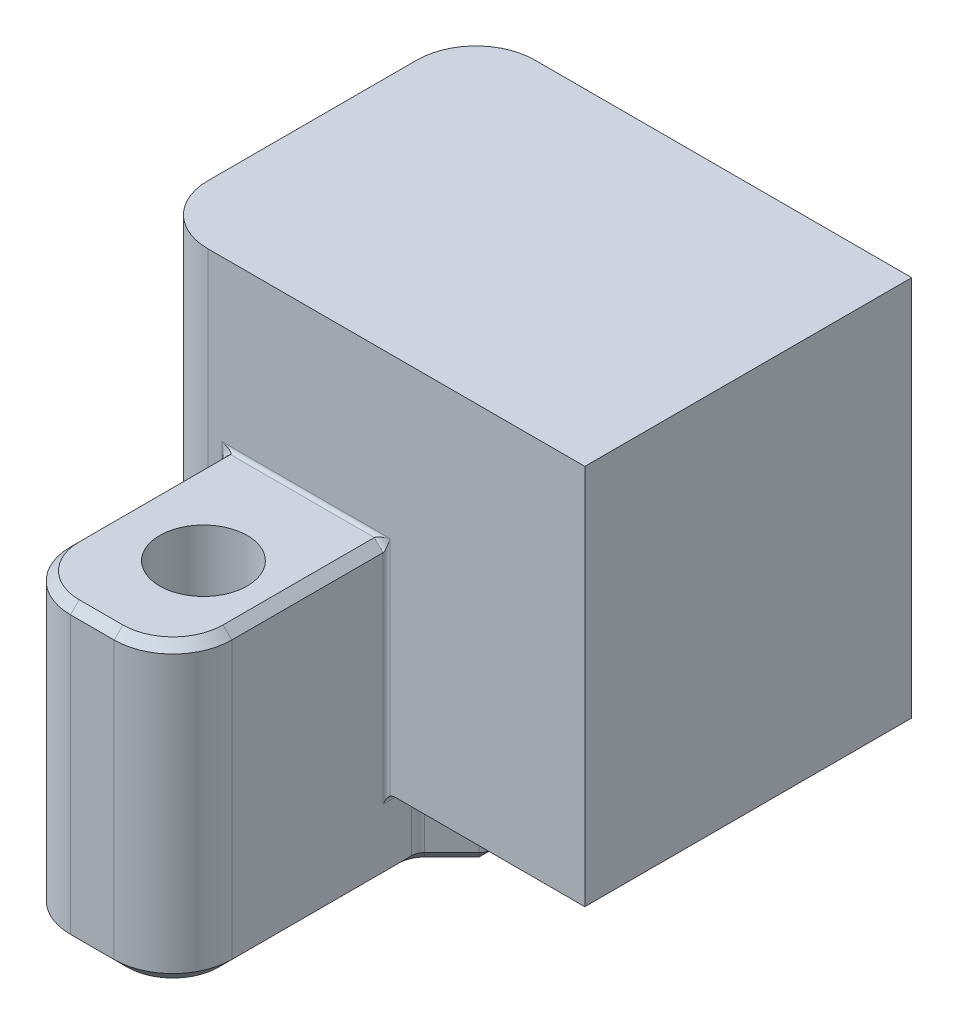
ISO-10303-21;
HEADER;
FILE_DESCRIPTION(('STEP AP214'),'2;1');
FILE_NAME('part.step','',(''),(''),'','','');
FILE_SCHEMA(('AUTOMOTIVE_DESIGN { 1 0 10303 214 1 1 1 1 }'));
ENDSEC;
DATA;
#1=APPLICATION_CONTEXT('core data for automotive mechanical design processes');
#2=APPLICATION_PROTOCOL_DEFINITION('international standard','automotive_design',2000,#1);
#3=PRODUCT_CONTEXT('',#1,'mechanical');
#4=PRODUCT('Part','Part','',(#3));
#5=PRODUCT_RELATED_PRODUCT_CATEGORY('part','',(#4));
#6=PRODUCT_DEFINITION_FORMATION('','',#4);
#7=PRODUCT_DEFINITION_CONTEXT('part definition',#1,'design');
#8=PRODUCT_DEFINITION('design','',#6,#7);
#9=PRODUCT_DEFINITION_SHAPE('','',#8);
#10=(LENGTH_UNIT() NAMED_UNIT(*) SI_UNIT(.MILLI.,.METRE.));
#11=(NAMED_UNIT(*) PLANE_ANGLE_UNIT() SI_UNIT($,.RADIAN.));
#12=(NAMED_UNIT(*) SI_UNIT($,.STERADIAN.) SOLID_ANGLE_UNIT());
#13=UNCERTAINTY_MEASURE_WITH_UNIT(LENGTH_MEASURE(1.E-05),#10,'distance_accuracy_value','');
#14=(GEOMETRIC_REPRESENTATION_CONTEXT(3) GLOBAL_UNCERTAINTY_ASSIGNED_CONTEXT((#13)) GLOBAL_UNIT_ASSIGNED_CONTEXT((#10,
#11,#12)) REPRESENTATION_CONTEXT('',''));
#15=CARTESIAN_POINT('',(0.,0.,0.));
#16=DIRECTION('',(0.,0.,1.));
#17=DIRECTION('',(1.,0.,0.));
#18=AXIS2_PLACEMENT_3D('',#15,#16,#17);
#19=CARTESIAN_POINT('',(0.,0.,9.525));
#20=DIRECTION('',(0.,0.,-1.));
#21=DIRECTION('',(-1.,0.,0.));
#22=AXIS2_PLACEMENT_3D('',#19,#20,#21);
#23=PLANE('',#22);
#24=DIRECTION('',(0.,1.,0.));
#25=VECTOR('',#24,1.);
#26=CARTESIAN_POINT('',(-21.971,-26.924,9.525));
#27=LINE('',#26,#25);
#28=CARTESIAN_POINT('',(-21.971,0.,9.525));
#29=VERTEX_POINT('',#28);
#30=CARTESIAN_POINT('',(-21.971,-26.162,9.525));
#31=VERTEX_POINT('',#30);
#32=EDGE_CURVE('E336',#29,#31,#27,.F.);
#33=ORIENTED_EDGE('',*,*,#32,.T.);
#34=DIRECTION('',(1.,0.,0.));
#35=VECTOR('',#34,1.);
#36=CARTESIAN_POINT('',(0.,-26.162,9.525));
#37=LINE('',#36,#35);
#38=CARTESIAN_POINT('',(-21.1582,-26.162,9.525));
#39=VERTEX_POINT('',#38);
#40=EDGE_CURVE('E1358',#31,#39,#37,.T.);
#41=ORIENTED_EDGE('',*,*,#40,.T.);
#42=DIRECTION('',(0.,-1.,0.));
#43=VECTOR('',#42,1.);
#44=CARTESIAN_POINT('',(-21.1582,0.,9.525));
#45=LINE('',#44,#43);
#46=CARTESIAN_POINT('',(-21.1582,-9.3218,9.525));
#47=VERTEX_POINT('',#46);
#48=EDGE_CURVE('E1023',#39,#47,#45,.F.);
#49=ORIENTED_EDGE('',*,*,#48,.T.);
#50=DIRECTION('',(1.,0.,0.));
#51=VECTOR('',#50,1.);
#52=CARTESIAN_POINT('',(0.,-9.3218,9.525));
#53=LINE('',#52,#51);
#54=CARTESIAN_POINT('',(-11.3538,-9.3218,9.525));
#55=VERTEX_POINT('',#54);
#56=EDGE_CURVE('E338',#47,#55,#53,.T.);
#57=ORIENTED_EDGE('',*,*,#56,.T.);
#58=DIRECTION('',(0.,-1.,0.));
#59=VECTOR('',#58,1.);
#60=CARTESIAN_POINT('',(-11.3538,0.,9.525));
#61=LINE('',#60,#59);
#62=CARTESIAN_POINT('',(-11.3538,-22.3265999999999,9.525));
#63=VERTEX_POINT('',#62);
#64=EDGE_CURVE('E349',#55,#63,#61,.T.);
#65=ORIENTED_EDGE('',*,*,#64,.T.);
#66=CARTESIAN_POINT('',(-11.049,-22.733,9.525));
#67=DIRECTION('',(0.,0.,-1.));
#68=DIRECTION('',(-1.,0.,0.));
#69=AXIS2_PLACEMENT_3D('',#66,#67,#68);
#70=CIRCLE('',#69,0.508);
#71=CARTESIAN_POINT('',(-11.049,-22.225,9.525));
#72=VERTEX_POINT('',#71);
#73=EDGE_CURVE('E305',#63,#72,#70,.T.);
#74=ORIENTED_EDGE('',*,*,#73,.T.);
#75=DIRECTION('',(-1.,0.,0.));
#76=VECTOR('',#75,1.);
#77=CARTESIAN_POINT('',(0.,-22.225,9.525));
#78=LINE('',#77,#76);
#79=CARTESIAN_POINT('',(0.,-22.225,9.525));
#80=VERTEX_POINT('',#79);
#81=EDGE_CURVE('E289',#80,#72,#78,.T.);
#82=ORIENTED_EDGE('',*,*,#81,.F.);
#83=DIRECTION('',(0.,-1.,0.));
#84=VECTOR('',#83,1.);
#85=CARTESIAN_POINT('',(0.,0.,9.525));
#86=LINE('',#85,#84);
#87=CARTESIAN_POINT('',(0.,0.,9.525));
#88=VERTEX_POINT('',#87);
#89=EDGE_CURVE('E303',#88,#80,#86,.T.);
#90=ORIENTED_EDGE('',*,*,#89,.F.);
#91=DIRECTION('',(1.,0.,0.));
#92=VECTOR('',#91,1.);
#93=CARTESIAN_POINT('',(-25.4,0.,9.525));
#94=LINE('',#93,#92);
#95=EDGE_CURVE('E298',#29,#88,#94,.T.);
#96=ORIENTED_EDGE('',*,*,#95,.F.);
#97=EDGE_LOOP('',(#33,#41,#49,#57,#65,#74,#82,#90,#96));
#98=FACE_BOUND('',#97,.T.);
#99=ADVANCED_FACE('F45',(#98),#23,.F.);
#100=CARTESIAN_POINT('',(-11.3538,0.,9.7282));
#101=DIRECTION('',(0.,-1.,0.));
#102=DIRECTION('',(0.,0.,-1.));
#103=AXIS2_PLACEMENT_3D('',#100,#101,#102);
#104=CYLINDRICAL_SURFACE('',#103,0.2032);
#105=ORIENTED_EDGE('',*,*,#64,.F.);
#106=CARTESIAN_POINT('',(-11.557,-10.033,9.7282));
#107=CARTESIAN_POINT('',(-11.5570008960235,-10.0330031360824,9.71490051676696));
#108=CARTESIAN_POINT('',(-11.5556901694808,-10.0284155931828,9.70160158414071));
#109=CARTESIAN_POINT('',(-11.5505009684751,-10.0102533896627,9.67551370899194));
#110=CARTESIAN_POINT('',(-11.5466222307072,-9.99667780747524,9.66272607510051));
#111=CARTESIAN_POINT('',(-11.5364424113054,-9.9610484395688,9.63815137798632));
#112=CARTESIAN_POINT('',(-11.5301434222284,-9.93900197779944,9.62636624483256));
#113=CARTESIAN_POINT('',(-11.5153658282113,-9.88728039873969,9.60425001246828));
#114=CARTESIAN_POINT('',(-11.506888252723,-9.8576088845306,9.59392005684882));
#115=CARTESIAN_POINT('',(-11.4880799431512,-9.79177980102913,9.57511174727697));
#116=CARTESIAN_POINT('',(-11.4777499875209,-9.75562495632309,9.56663417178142));
#117=CARTESIAN_POINT('',(-11.4556337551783,-9.67821814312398,9.55185657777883));
#118=CARTESIAN_POINT('',(-11.443849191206,-9.63697216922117,9.54555717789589));
#119=CARTESIAN_POINT('',(-11.4069854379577,-9.50794903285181,9.53028868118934));
#120=CARTESIAN_POINT('',(-11.3804011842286,-9.41490414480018,9.52498583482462));
#121=CARTESIAN_POINT('',(-11.3538,-9.3218,9.525));
#122=B_SPLINE_CURVE_WITH_KNOTS('',3,(#106,#107,#108,#109,#110,#111,#112,#113,#114,#115,#116,
#117,#118,#119,#120,#121),.UNSPECIFIED.,.F.,.F.,(4,2,2,2,2,2,2,4),(0.,0.196349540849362,
0.392699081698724,0.589048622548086,0.785398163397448,0.98174770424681,1.17809724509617,
1.5707963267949),.UNSPECIFIED.);
#123=CARTESIAN_POINT('',(-11.557,-10.033,9.7282));
#124=VERTEX_POINT('',#123);
#125=EDGE_CURVE('E356',#55,#124,#122,.F.);
#126=ORIENTED_EDGE('',*,*,#125,.T.);
#127=DIRECTION('',(0.,-1.,0.));
#128=VECTOR('',#127,1.);
#129=CARTESIAN_POINT('',(-11.557,15.5956827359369,9.7282));
#130=LINE('',#129,#128);
#131=CARTESIAN_POINT('',(-11.557,-22.733,9.7282));
#132=VERTEX_POINT('',#131);
#133=EDGE_CURVE('E344',#132,#124,#130,.F.);
#134=ORIENTED_EDGE('',*,*,#133,.F.);
#135=CARTESIAN_POINT('',(-11.3538,-22.3265999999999,9.525));
#136=CARTESIAN_POINT('',(-11.3677301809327,-22.3370315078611,9.52501854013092));
#137=CARTESIAN_POINT('',(-11.3810312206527,-22.3481400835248,9.52642668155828));
#138=CARTESIAN_POINT('',(-11.4061060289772,-22.3713038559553,9.53143250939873));
#139=CARTESIAN_POINT('',(-11.4178934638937,-22.3833487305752,9.53500864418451));
#140=CARTESIAN_POINT('',(-11.4446303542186,-22.4134649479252,9.54564523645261));
#141=CARTESIAN_POINT('',(-11.4587987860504,-22.4319245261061,9.55354031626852));
#142=CARTESIAN_POINT('',(-11.4841650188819,-22.4699015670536,9.57155189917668));
#143=CARTESIAN_POINT('',(-11.4953439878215,-22.4894248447,9.58168178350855));
#144=CARTESIAN_POINT('',(-11.5188415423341,-22.5373209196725,9.60787914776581));
#145=CARTESIAN_POINT('',(-11.5297119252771,-22.5660076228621,9.62466736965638));
#146=CARTESIAN_POINT('',(-11.546060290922,-22.623917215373,9.65965653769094));
#147=CARTESIAN_POINT('',(-11.5515482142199,-22.6531390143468,9.67785481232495));
#148=CARTESIAN_POINT('',(-11.5560343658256,-22.698010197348,9.70607520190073));
#149=CARTESIAN_POINT('',(-11.5568688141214,-22.7136006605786,9.71593112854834));
#150=CARTESIAN_POINT('',(-11.5569952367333,-22.7304601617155,9.72659366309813));
#151=CARTESIAN_POINT('',(-11.5569999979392,-22.7317300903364,9.72739683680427));
#152=CARTESIAN_POINT('',(-11.557,-22.733,9.7282));
#153=B_SPLINE_CURVE_WITH_KNOTS('',3,(#135,#136,#137,#138,#139,#140,#141,#142,#143,#144,#145,
#146,#147,#148,#149,#150,#151,#152),.UNSPECIFIED.,.F.,.F.,(4,2,2,2,2,2,2,2,4),(0.,
0.0519887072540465,0.103468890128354,0.17679641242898,0.250575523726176,0.354935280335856,
0.459101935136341,0.51443907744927,0.518946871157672),.UNSPECIFIED.);
#154=EDGE_CURVE('E380',#132,#63,#153,.F.);
#155=ORIENTED_EDGE('',*,*,#154,.T.);
#156=EDGE_LOOP('',(#105,#126,#134,#155));
#157=FACE_BOUND('',#156,.T.);
#158=ADVANCED_FACE('F363',(#157),#104,.F.);
#159=CARTESIAN_POINT('',(0.,0.,9.525));
#160=DIRECTION('',(1.,0.,0.));
#161=DIRECTION('',(0.,1.,0.));
#162=AXIS2_PLACEMENT_3D('',#159,#160,#161);
#163=PLANE('',#162);
#164=DIRECTION('',(0.,-1.,0.));
#165=VECTOR('',#164,1.);
#166=CARTESIAN_POINT('',(0.,0.,-9.525));
#167=LINE('',#166,#165);
#168=CARTESIAN_POINT('',(0.,0.,-9.525));
#169=VERTEX_POINT('',#168);
#170=CARTESIAN_POINT('',(0.,-22.225,-9.525));
#171=VERTEX_POINT('',#170);
#172=EDGE_CURVE('E319',#169,#171,#167,.T.);
#173=ORIENTED_EDGE('',*,*,#172,.F.);
#174=DIRECTION('',(0.,0.,-1.));
#175=VECTOR('',#174,1.);
#176=CARTESIAN_POINT('',(0.,0.,9.525));
#177=LINE('',#176,#175);
#178=EDGE_CURVE('E310',#88,#169,#177,.T.);
#179=ORIENTED_EDGE('',*,*,#178,.F.);
#180=ORIENTED_EDGE('',*,*,#89,.T.);
#181=DIRECTION('',(0.,0.,-1.));
#182=VECTOR('',#181,1.);
#183=CARTESIAN_POINT('',(0.,-22.225,9.525));
#184=LINE('',#183,#182);
#185=EDGE_CURVE('E286',#80,#171,#184,.T.);
#186=ORIENTED_EDGE('',*,*,#185,.T.);
#187=EDGE_LOOP('',(#173,#179,#180,#186));
#188=FACE_BOUND('',#187,.T.);
#189=ADVANCED_FACE('F308',(#188),#163,.T.);
#190=CARTESIAN_POINT('',(-25.4,0.,9.525));
#191=DIRECTION('',(0.,1.,0.));
#192=DIRECTION('',(0.,0.,1.));
#193=AXIS2_PLACEMENT_3D('',#190,#191,#192);
#194=PLANE('',#193);
#195=DIRECTION('',(1.,0.,0.));
#196=VECTOR('',#195,1.);
#197=CARTESIAN_POINT('',(-25.4,0.,-9.525));
#198=LINE('',#197,#196);
#199=CARTESIAN_POINT('',(-21.971,0.,-9.525));
#200=VERTEX_POINT('',#199);
#201=EDGE_CURVE('E311',#200,#169,#198,.T.);
#202=ORIENTED_EDGE('',*,*,#201,.F.);
#203=CARTESIAN_POINT('',(-21.971,0.,-6.096));
#204=DIRECTION('',(0.,1.,0.));
#205=DIRECTION('',(0.,0.,1.));
#206=AXIS2_PLACEMENT_3D('',#203,#204,#205);
#207=CIRCLE('',#206,3.429);
#208=CARTESIAN_POINT('',(-25.4,0.,-6.096));
#209=VERTEX_POINT('',#208);
#210=EDGE_CURVE('E330',#200,#209,#207,.T.);
#211=ORIENTED_EDGE('',*,*,#210,.T.);
#212=DIRECTION('',(0.,0.,-1.));
#213=VECTOR('',#212,1.);
#214=CARTESIAN_POINT('',(-25.4,0.,9.525));
#215=LINE('',#214,#213);
#216=CARTESIAN_POINT('',(-25.4,0.,6.096));
#217=VERTEX_POINT('',#216);
#218=EDGE_CURVE('E297',#217,#209,#215,.T.);
#219=ORIENTED_EDGE('',*,*,#218,.F.);
#220=CARTESIAN_POINT('',(-21.971,0.,6.096));
#221=DIRECTION('',(0.,1.,0.));
#222=DIRECTION('',(0.,0.,1.));
#223=AXIS2_PLACEMENT_3D('',#220,#221,#222);
#224=CIRCLE('',#223,3.429);
#225=EDGE_CURVE('E328',#217,#29,#224,.T.);
#226=ORIENTED_EDGE('',*,*,#225,.T.);
#227=ORIENTED_EDGE('',*,*,#95,.T.);
#228=ORIENTED_EDGE('',*,*,#178,.T.);
#229=EDGE_LOOP('',(#202,#211,#219,#226,#227,#228));
#230=FACE_BOUND('',#229,.T.);
#231=ADVANCED_FACE('F453',(#230),#194,.T.);
#232=CARTESIAN_POINT('',(-25.4,-26.924,9.525));
#233=DIRECTION('',(-1.,0.,0.));
#234=DIRECTION('',(0.,0.,1.));
#235=AXIS2_PLACEMENT_3D('',#232,#233,#234);
#236=PLANE('',#235);
#237=DIRECTION('',(0.,1.,0.));
#238=VECTOR('',#237,1.);
#239=CARTESIAN_POINT('',(-25.4,-26.924,-6.096));
#240=LINE('',#239,#238);
#241=CARTESIAN_POINT('',(-25.4,-26.162,-6.096));
#242=VERTEX_POINT('',#241);
#243=EDGE_CURVE('E334',#209,#242,#240,.F.);
#244=ORIENTED_EDGE('',*,*,#243,.T.);
#245=DIRECTION('',(0.,0.,1.));
#246=VECTOR('',#245,1.);
#247=CARTESIAN_POINT('',(-25.4,-26.162,6.096));
#248=LINE('',#247,#246);
#249=CARTESIAN_POINT('',(-25.4,-26.162,6.096));
#250=VERTEX_POINT('',#249);
#251=EDGE_CURVE('E12',#242,#250,#248,.T.);
#252=ORIENTED_EDGE('',*,*,#251,.T.);
#253=DIRECTION('',(0.,1.,0.));
#254=VECTOR('',#253,1.);
#255=CARTESIAN_POINT('',(-25.4,0.,6.096));
#256=LINE('',#255,#254);
#257=EDGE_CURVE('E332',#250,#217,#256,.T.);
#258=ORIENTED_EDGE('',*,*,#257,.T.);
#259=ORIENTED_EDGE('',*,*,#218,.T.);
#260=EDGE_LOOP('',(#244,#252,#258,#259));
#261=FACE_BOUND('',#260,.T.);
#262=ADVANCED_FACE('F456',(#261),#236,.T.);
#263=CARTESIAN_POINT('',(-25.4,-26.924,9.525));
#264=DIRECTION('',(0.,1.,0.));
#265=DIRECTION('',(0.,0.,1.));
#266=AXIS2_PLACEMENT_3D('',#263,#264,#265);
#267=PLANE('',#266);
#268=DIRECTION('',(1.,0.,0.));
#269=VECTOR('',#268,1.);
#270=CARTESIAN_POINT('',(-13.6506307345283,-26.924,-8.763));
#271=LINE('',#270,#269);
#272=CARTESIAN_POINT('',(-21.971,-26.924,-8.763));
#273=VERTEX_POINT('',#272);
#274=CARTESIAN_POINT('',(-13.6506307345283,-26.924,-8.763));
#275=VERTEX_POINT('',#274);
#276=EDGE_CURVE('E983',#273,#275,#271,.T.);
#277=ORIENTED_EDGE('',*,*,#276,.T.);
#278=DIRECTION('',(0.707106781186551,0.,0.707106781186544));
#279=VECTOR('',#278,1.);
#280=CARTESIAN_POINT('',(-10.3813153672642,-26.924,-5.49368463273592));
#281=LINE('',#280,#279);
#282=CARTESIAN_POINT('',(-10.287,-26.924,-5.3993692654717));
#283=VERTEX_POINT('',#282);
#284=EDGE_CURVE('E1003',#275,#283,#281,.T.);
#285=ORIENTED_EDGE('',*,*,#284,.T.);
#286=DIRECTION('',(0.,0.,1.));
#287=VECTOR('',#286,1.);
#288=CARTESIAN_POINT('',(-10.287,-26.924,9.525));
#289=LINE('',#288,#287);
#290=CARTESIAN_POINT('',(-10.287,-26.924,5.3993692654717));
#291=VERTEX_POINT('',#290);
#292=EDGE_CURVE('E1001',#283,#291,#289,.T.);
#293=ORIENTED_EDGE('',*,*,#292,.T.);
#294=DIRECTION('',(-0.707106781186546,0.,0.707106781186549));
#295=VECTOR('',#294,1.);
#296=CARTESIAN_POINT('',(-19.9063153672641,-26.924,15.0186846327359));
#297=LINE('',#296,#295);
#298=CARTESIAN_POINT('',(-11.8726307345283,-26.924,6.985));
#299=VERTEX_POINT('',#298);
#300=EDGE_CURVE('E999',#291,#299,#297,.T.);
#301=ORIENTED_EDGE('',*,*,#300,.T.);
#302=CARTESIAN_POINT('',(-10.795,-26.924,8.06263073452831));
#303=DIRECTION('',(0.,1.,0.));
#304=DIRECTION('',(0.,0.,1.));
#305=AXIS2_PLACEMENT_3D('',#302,#303,#304);
#306=CIRCLE('',#305,1.52400000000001);
#307=CARTESIAN_POINT('',(-12.319,-26.924,8.06263073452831));
#308=VERTEX_POINT('',#307);
#309=EDGE_CURVE('E997',#299,#308,#306,.T.);
#310=ORIENTED_EDGE('',*,*,#309,.T.);
#311=DIRECTION('',(0.,0.,1.));
#312=VECTOR('',#311,1.);
#313=CARTESIAN_POINT('',(-12.319,-26.924,18.542));
#314=LINE('',#313,#312);
#315=CARTESIAN_POINT('',(-12.319,-26.924,18.542));
#316=VERTEX_POINT('',#315);
#317=EDGE_CURVE('E995',#308,#316,#314,.T.);
#318=ORIENTED_EDGE('',*,*,#317,.T.);
#319=CARTESIAN_POINT('',(-14.986,-26.924,18.542));
#320=DIRECTION('',(0.,1.,0.));
#321=DIRECTION('',(0.,0.,1.));
#322=AXIS2_PLACEMENT_3D('',#319,#320,#321);
#323=CIRCLE('',#322,2.66700000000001);
#324=CARTESIAN_POINT('',(-14.986,-26.924,21.209));
#325=VERTEX_POINT('',#324);
#326=EDGE_CURVE('E993',#316,#325,#323,.F.);
#327=ORIENTED_EDGE('',*,*,#326,.T.);
#328=DIRECTION('',(-1.,0.,0.));
#329=VECTOR('',#328,1.);
#330=CARTESIAN_POINT('',(-17.526,-26.924,21.209));
#331=LINE('',#330,#329);
#332=CARTESIAN_POINT('',(-17.526,-26.924,21.209));
#333=VERTEX_POINT('',#332);
#334=EDGE_CURVE('E991',#325,#333,#331,.T.);
#335=ORIENTED_EDGE('',*,*,#334,.T.);
#336=CARTESIAN_POINT('',(-17.526,-26.924,18.542));
#337=DIRECTION('',(0.,1.,0.));
#338=DIRECTION('',(0.,0.,1.));
#339=AXIS2_PLACEMENT_3D('',#336,#337,#338);
#340=CIRCLE('',#339,2.66700000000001);
#341=CARTESIAN_POINT('',(-20.193,-26.924,18.542));
#342=VERTEX_POINT('',#341);
#343=EDGE_CURVE('E989',#333,#342,#340,.F.);
#344=ORIENTED_EDGE('',*,*,#343,.T.);
#345=DIRECTION('',(0.,0.,-1.));
#346=VECTOR('',#345,1.);
#347=CARTESIAN_POINT('',(-20.193,-26.924,9.7282));
#348=LINE('',#347,#346);
#349=CARTESIAN_POINT('',(-20.193,-26.924,9.7282));
#350=VERTEX_POINT('',#349);
#351=EDGE_CURVE('E987',#342,#350,#348,.T.);
#352=ORIENTED_EDGE('',*,*,#351,.T.);
#353=CARTESIAN_POINT('',(-21.1582,-26.924,9.7282));
#354=DIRECTION('',(0.,1.,0.));
#355=DIRECTION('',(0.,0.,1.));
#356=AXIS2_PLACEMENT_3D('',#353,#354,#355);
#357=CIRCLE('',#356,0.965199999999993);
#358=CARTESIAN_POINT('',(-21.1582,-26.924,8.763));
#359=VERTEX_POINT('',#358);
#360=EDGE_CURVE('E985',#350,#359,#357,.T.);
#361=ORIENTED_EDGE('',*,*,#360,.T.);
#362=DIRECTION('',(-1.,0.,0.));
#363=VECTOR('',#362,1.);
#364=CARTESIAN_POINT('',(-25.4,-26.924,8.763));
#365=LINE('',#364,#363);
#366=CARTESIAN_POINT('',(-21.971,-26.924,8.763));
#367=VERTEX_POINT('',#366);
#368=EDGE_CURVE('E979',#359,#367,#365,.T.);
#369=ORIENTED_EDGE('',*,*,#368,.T.);
#370=CARTESIAN_POINT('',(-21.971,-26.924,6.096));
#371=DIRECTION('',(0.,1.,0.));
#372=DIRECTION('',(0.,0.,1.));
#373=AXIS2_PLACEMENT_3D('',#370,#371,#372);
#374=CIRCLE('',#373,2.667);
#375=CARTESIAN_POINT('',(-24.638,-26.924,6.096));
#376=VERTEX_POINT('',#375);
#377=EDGE_CURVE('E977',#367,#376,#374,.F.);
#378=ORIENTED_EDGE('',*,*,#377,.T.);
#379=DIRECTION('',(0.,0.,-1.));
#380=VECTOR('',#379,1.);
#381=CARTESIAN_POINT('',(-24.638,-26.924,-6.096));
#382=LINE('',#381,#380);
#383=CARTESIAN_POINT('',(-24.638,-26.924,-6.096));
#384=VERTEX_POINT('',#383);
#385=EDGE_CURVE('E975',#376,#384,#382,.T.);
#386=ORIENTED_EDGE('',*,*,#385,.T.);
#387=CARTESIAN_POINT('',(-21.971,-26.924,-6.096));
#388=DIRECTION('',(0.,1.,0.));
#389=DIRECTION('',(0.,0.,1.));
#390=AXIS2_PLACEMENT_3D('',#387,#388,#389);
#391=CIRCLE('',#390,2.667);
#392=EDGE_CURVE('E981',#384,#273,#391,.F.);
#393=ORIENTED_EDGE('',*,*,#392,.T.);
#394=EDGE_LOOP('',(#277,#285,#293,#301,#310,#318,#327,#335,#344,#352,#361,#369,#378,#386,#393));
#395=FACE_BOUND('',#394,.T.);
#396=CARTESIAN_POINT('',(-15.875,-26.924,15.875));
#397=DIRECTION('',(0.,1.,0.));
#398=DIRECTION('',(0.,0.,1.));
#399=AXIS2_PLACEMENT_3D('',#396,#397,#398);
#400=CIRCLE('',#399,2.55269999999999);
#401=CARTESIAN_POINT('',(-15.875,-26.924,18.4277));
#402=VERTEX_POINT('',#401);
#403=EDGE_CURVE('E1324',#402,#402,#400,.T.);
#404=ORIENTED_EDGE('',*,*,#403,.T.);
#405=EDGE_LOOP('',(#404));
#406=FACE_BOUND('',#405,.T.);
#407=ADVANCED_FACE('F460',(#395,#406),#267,.F.);
#408=CARTESIAN_POINT('',(-9.525,-26.924,9.525));
#409=DIRECTION('',(-1.,0.,0.));
#410=DIRECTION('',(0.,0.,1.));
#411=AXIS2_PLACEMENT_3D('',#408,#409,#410);
#412=PLANE('',#411);
#413=DIRECTION('',(0.,-1.,0.));
#414=VECTOR('',#413,1.);
#415=CARTESIAN_POINT('',(-9.525,-26.924,5.3993692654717));
#416=LINE('',#415,#414);
#417=CARTESIAN_POINT('',(-9.525,-22.733,5.3993692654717));
#418=VERTEX_POINT('',#417);
#419=CARTESIAN_POINT('',(-9.525,-26.162,5.3993692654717));
#420=VERTEX_POINT('',#419);
#421=EDGE_CURVE('E1176',#418,#420,#416,.T.);
#422=ORIENTED_EDGE('',*,*,#421,.T.);
#423=DIRECTION('',(0.,0.,-1.));
#424=VECTOR('',#423,1.);
#425=CARTESIAN_POINT('',(-9.525,-26.162,9.525));
#426=LINE('',#425,#424);
#427=CARTESIAN_POINT('',(-9.525,-26.162,-5.3993692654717));
#428=VERTEX_POINT('',#427);
#429=EDGE_CURVE('E1008',#420,#428,#426,.T.);
#430=ORIENTED_EDGE('',*,*,#429,.T.);
#431=DIRECTION('',(0.,-1.,0.));
#432=VECTOR('',#431,1.);
#433=CARTESIAN_POINT('',(-9.525,-26.924,-5.3993692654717));
#434=LINE('',#433,#432);
#435=CARTESIAN_POINT('',(-9.525,-22.733,-5.3993692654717));
#436=VERTEX_POINT('',#435);
#437=EDGE_CURVE('E1179',#428,#436,#434,.F.);
#438=ORIENTED_EDGE('',*,*,#437,.T.);
#439=DIRECTION('',(0.,0.,-1.));
#440=VECTOR('',#439,1.);
#441=CARTESIAN_POINT('',(-9.525,-22.733,9.525));
#442=LINE('',#441,#440);
#443=EDGE_CURVE('E389',#436,#418,#442,.F.);
#444=ORIENTED_EDGE('',*,*,#443,.T.);
#445=EDGE_LOOP('',(#422,#430,#438,#444));
#446=FACE_BOUND('',#445,.T.);
#447=ADVANCED_FACE('F463',(#446),#412,.F.);
#448=CARTESIAN_POINT('',(0.,-22.225,9.525));
#449=DIRECTION('',(0.,-1.,0.));
#450=DIRECTION('',(1.,0.,0.));
#451=AXIS2_PLACEMENT_3D('',#448,#449,#450);
#452=PLANE('',#451);
#453=ORIENTED_EDGE('',*,*,#81,.T.);
#454=DIRECTION('',(0.,0.,1.));
#455=VECTOR('',#454,1.);
#456=CARTESIAN_POINT('',(-11.049,-22.225,8.06263073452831));
#457=LINE('',#456,#455);
#458=CARTESIAN_POINT('',(-11.049,-22.225,8.06263073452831));
#459=VERTEX_POINT('',#458);
#460=EDGE_CURVE('E1203',#72,#459,#457,.F.);
#461=ORIENTED_EDGE('',*,*,#460,.T.);
#462=CARTESIAN_POINT('',(-10.795,-22.225,8.06263073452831));
#463=DIRECTION('',(0.,-1.,0.));
#464=DIRECTION('',(1.,0.,0.));
#465=AXIS2_PLACEMENT_3D('',#462,#463,#464);
#466=CIRCLE('',#465,0.254);
#467=CARTESIAN_POINT('',(-10.9746051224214,-22.225,7.88302561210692));
#468=VERTEX_POINT('',#467);
#469=EDGE_CURVE('E1201',#459,#468,#466,.T.);
#470=ORIENTED_EDGE('',*,*,#469,.T.);
#471=DIRECTION('',(-0.707106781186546,0.,0.707106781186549));
#472=VECTOR('',#471,1.);
#473=CARTESIAN_POINT('',(-6.30828975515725,-22.225,3.21671024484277));
#474=LINE('',#473,#472);
#475=CARTESIAN_POINT('',(-9.38897438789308,-22.225,6.29739487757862));
#476=VERTEX_POINT('',#475);
#477=EDGE_CURVE('E1199',#468,#476,#474,.F.);
#478=ORIENTED_EDGE('',*,*,#477,.T.);
#479=CARTESIAN_POINT('',(-10.287,-22.225,5.3993692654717));
#480=DIRECTION('',(0.,-1.,0.));
#481=DIRECTION('',(1.,0.,0.));
#482=AXIS2_PLACEMENT_3D('',#479,#480,#481);
#483=CIRCLE('',#482,1.27);
#484=CARTESIAN_POINT('',(-9.017,-22.225,5.3993692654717));
#485=VERTEX_POINT('',#484);
#486=EDGE_CURVE('E1197',#476,#485,#483,.F.);
#487=ORIENTED_EDGE('',*,*,#486,.T.);
#488=DIRECTION('',(0.,0.,-1.));
#489=VECTOR('',#488,1.);
#490=CARTESIAN_POINT('',(-9.017,-22.225,9.525));
#491=LINE('',#490,#489);
#492=CARTESIAN_POINT('',(-9.017,-22.225,-5.3993692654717));
#493=VERTEX_POINT('',#492);
#494=EDGE_CURVE('E1191',#485,#493,#491,.T.);
#495=ORIENTED_EDGE('',*,*,#494,.T.);
#496=CARTESIAN_POINT('',(-10.287,-22.225,-5.3993692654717));
#497=DIRECTION('',(0.,-1.,0.));
#498=DIRECTION('',(1.,0.,0.));
#499=AXIS2_PLACEMENT_3D('',#496,#497,#498);
#500=CIRCLE('',#499,1.27);
#501=CARTESIAN_POINT('',(-9.38897438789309,-22.225,-6.29739487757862));
#502=VERTEX_POINT('',#501);
#503=EDGE_CURVE('E1193',#493,#502,#500,.F.);
#504=ORIENTED_EDGE('',*,*,#503,.T.);
#505=DIRECTION('',(0.707106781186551,0.,0.707106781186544));
#506=VECTOR('',#505,1.);
#507=CARTESIAN_POINT('',(3.21671024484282,-22.225,6.30828975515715));
#508=LINE('',#507,#506);
#509=CARTESIAN_POINT('',(-12.6165795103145,-22.225,-9.525));
#510=VERTEX_POINT('',#509);
#511=EDGE_CURVE('E1195',#502,#510,#508,.F.);
#512=ORIENTED_EDGE('',*,*,#511,.T.);
#513=DIRECTION('',(-1.,0.,0.));
#514=VECTOR('',#513,1.);
#515=CARTESIAN_POINT('',(0.,-22.225,-9.525));
#516=LINE('',#515,#514);
#517=EDGE_CURVE('E292',#171,#510,#516,.T.);
#518=ORIENTED_EDGE('',*,*,#517,.F.);
#519=ORIENTED_EDGE('',*,*,#185,.F.);
#520=EDGE_LOOP('',(#453,#461,#470,#478,#487,#495,#504,#512,#518,#519));
#521=FACE_BOUND('',#520,.T.);
#522=ADVANCED_FACE('F288',(#521),#452,.T.);
#523=CARTESIAN_POINT('',(0.,0.,-9.525));
#524=DIRECTION('',(0.,0.,-1.));
#525=DIRECTION('',(-1.,0.,0.));
#526=AXIS2_PLACEMENT_3D('',#523,#524,#525);
#527=PLANE('',#526);
#528=DIRECTION('',(0.,-1.,0.));
#529=VECTOR('',#528,1.);
#530=CARTESIAN_POINT('',(-13.6506307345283,-26.924,-9.525));
#531=LINE('',#530,#529);
#532=CARTESIAN_POINT('',(-13.6506307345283,-22.733,-9.525));
#533=VERTEX_POINT('',#532);
#534=CARTESIAN_POINT('',(-13.6506307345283,-26.162,-9.525));
#535=VERTEX_POINT('',#534);
#536=EDGE_CURVE('E1166',#533,#535,#531,.T.);
#537=ORIENTED_EDGE('',*,*,#536,.T.);
#538=DIRECTION('',(-1.,0.,0.));
#539=VECTOR('',#538,1.);
#540=CARTESIAN_POINT('',(-21.971,-26.162,-9.525));
#541=LINE('',#540,#539);
#542=CARTESIAN_POINT('',(-21.971,-26.162,-9.525));
#543=VERTEX_POINT('',#542);
#544=EDGE_CURVE('E1278',#535,#543,#541,.T.);
#545=ORIENTED_EDGE('',*,*,#544,.T.);
#546=DIRECTION('',(0.,1.,0.));
#547=VECTOR('',#546,1.);
#548=CARTESIAN_POINT('',(-21.971,0.,-9.525));
#549=LINE('',#548,#547);
#550=EDGE_CURVE('E324',#543,#200,#549,.T.);
#551=ORIENTED_EDGE('',*,*,#550,.T.);
#552=ORIENTED_EDGE('',*,*,#201,.T.);
#553=ORIENTED_EDGE('',*,*,#172,.T.);
#554=ORIENTED_EDGE('',*,*,#517,.T.);
#555=CARTESIAN_POINT('',(-12.6165795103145,-22.733,-9.525));
#556=DIRECTION('',(0.,0.,-1.));
#557=DIRECTION('',(1.,0.,0.));
#558=AXIS2_PLACEMENT_3D('',#555,#556,#557);
#559=ELLIPSE('',#558,0.718420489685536,0.508);
#560=CARTESIAN_POINT('',(-12.8886307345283,-22.2628318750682,-9.525));
#561=VERTEX_POINT('',#560);
#562=EDGE_CURVE('E443',#510,#561,#559,.F.);
#563=ORIENTED_EDGE('',*,*,#562,.T.);
#564=CARTESIAN_POINT('',(-12.8886307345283,-22.2628318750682,-9.525));
#565=CARTESIAN_POINT('',(-12.958073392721,-22.2829788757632,-9.525));
#566=CARTESIAN_POINT('',(-13.0249333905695,-22.3098262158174,-9.525));
#567=CARTESIAN_POINT('',(-13.1532993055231,-22.3727475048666,-9.525));
#568=CARTESIAN_POINT('',(-13.2148584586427,-22.4087104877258,-9.525));
#569=CARTESIAN_POINT('',(-13.4048775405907,-22.5324894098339,-9.525));
#570=CARTESIAN_POINT('',(-13.5258400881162,-22.6311105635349,-9.525));
#571=CARTESIAN_POINT('',(-13.6477798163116,-22.7306722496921,-9.525));
#572=CARTESIAN_POINT('',(-13.6492052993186,-22.73183615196,-9.525));
#573=CARTESIAN_POINT('',(-13.6506307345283,-22.733,-9.525));
#574=B_SPLINE_CURVE_WITH_KNOTS('',3,(#564,#565,#566,#567,#568,#569,#570,#571,#572,#573),
.UNSPECIFIED.,.F.,.F.,(4,2,2,2,4),(0.,0.215706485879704,0.428903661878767,0.895632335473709,
0.90115320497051),.UNSPECIFIED.);
#575=EDGE_CURVE('E436',#561,#533,#574,.T.);
#576=ORIENTED_EDGE('',*,*,#575,.T.);
#577=EDGE_LOOP('',(#537,#545,#551,#552,#553,#554,#563,#576));
#578=FACE_BOUND('',#577,.T.);
#579=ADVANCED_FACE('F445',(#578),#527,.T.);
#580=CARTESIAN_POINT('',(-21.971,0.,-6.096));
#581=DIRECTION('',(0.,1.,0.));
#582=DIRECTION('',(0.,0.,1.));
#583=AXIS2_PLACEMENT_3D('',#580,#581,#582);
#584=CYLINDRICAL_SURFACE('',#583,3.429);
#585=ORIENTED_EDGE('',*,*,#550,.F.);
#586=CARTESIAN_POINT('',(-21.971,-26.162,-6.096));
#587=DIRECTION('',(0.,1.,0.));
#588=DIRECTION('',(0.,0.,1.));
#589=AXIS2_PLACEMENT_3D('',#586,#587,#588);
#590=CIRCLE('',#589,3.429);
#591=EDGE_CURVE('E1285',#543,#242,#590,.T.);
#592=ORIENTED_EDGE('',*,*,#591,.T.);
#593=ORIENTED_EDGE('',*,*,#243,.F.);
#594=ORIENTED_EDGE('',*,*,#210,.F.);
#595=EDGE_LOOP('',(#585,#592,#593,#594));
#596=FACE_BOUND('',#595,.T.);
#597=ADVANCED_FACE('F450',(#596),#584,.T.);
#598=CARTESIAN_POINT('',(-21.971,-26.924,6.096));
#599=DIRECTION('',(0.,-1.,0.));
#600=DIRECTION('',(0.,0.,-1.));
#601=AXIS2_PLACEMENT_3D('',#598,#599,#600);
#602=CYLINDRICAL_SURFACE('',#601,3.429);
#603=ORIENTED_EDGE('',*,*,#257,.F.);
#604=CARTESIAN_POINT('',(-21.971,-26.162,6.096));
#605=DIRECTION('',(0.,1.,0.));
#606=DIRECTION('',(0.,0.,1.));
#607=AXIS2_PLACEMENT_3D('',#604,#605,#606);
#608=CIRCLE('',#607,3.429);
#609=EDGE_CURVE('E55',#250,#31,#608,.T.);
#610=ORIENTED_EDGE('',*,*,#609,.T.);
#611=ORIENTED_EDGE('',*,*,#32,.F.);
#612=ORIENTED_EDGE('',*,*,#225,.F.);
#613=EDGE_LOOP('',(#603,#610,#611,#612));
#614=FACE_BOUND('',#613,.T.);
#615=ADVANCED_FACE('F373',(#614),#602,.T.);
#616=CARTESIAN_POINT('',(-25.4,-9.525,9.525));
#617=DIRECTION('',(0.,1.,0.));
#618=DIRECTION('',(0.,0.,1.));
#619=AXIS2_PLACEMENT_3D('',#616,#617,#618);
#620=PLANE('',#619);
#621=CARTESIAN_POINT('',(-15.875,-9.525,15.875));
#622=DIRECTION('',(0.,1.,0.));
#623=DIRECTION('',(0.,0.,1.));
#624=AXIS2_PLACEMENT_3D('',#621,#622,#623);
#625=CIRCLE('',#624,2.55269999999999);
#626=CARTESIAN_POINT('',(-15.875,-9.525,18.4277));
#627=VERTEX_POINT('',#626);
#628=EDGE_CURVE('E1319',#627,#627,#625,.T.);
#629=ORIENTED_EDGE('',*,*,#628,.F.);
#630=EDGE_LOOP('',(#629));
#631=FACE_BOUND('',#630,.T.);
#632=DIRECTION('',(1.,0.,0.));
#633=VECTOR('',#632,1.);
#634=CARTESIAN_POINT('',(-25.4,-9.525,9.7282));
#635=LINE('',#634,#633);
#636=CARTESIAN_POINT('',(-12.065,-9.525,9.7282));
#637=VERTEX_POINT('',#636);
#638=CARTESIAN_POINT('',(-20.447,-9.525,9.7282));
#639=VERTEX_POINT('',#638);
#640=EDGE_CURVE('E1035',#637,#639,#635,.F.);
#641=ORIENTED_EDGE('',*,*,#640,.T.);
#642=DIRECTION('',(0.,0.,1.));
#643=VECTOR('',#642,1.);
#644=CARTESIAN_POINT('',(-20.447,-9.525,9.525));
#645=LINE('',#644,#643);
#646=CARTESIAN_POINT('',(-20.447,-9.525,18.542));
#647=VERTEX_POINT('',#646);
#648=EDGE_CURVE('E1066',#639,#647,#645,.T.);
#649=ORIENTED_EDGE('',*,*,#648,.T.);
#650=CARTESIAN_POINT('',(-17.526,-9.525,18.542));
#651=DIRECTION('',(0.,1.,0.));
#652=DIRECTION('',(0.,0.,1.));
#653=AXIS2_PLACEMENT_3D('',#650,#651,#652);
#654=CIRCLE('',#653,2.92100000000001);
#655=CARTESIAN_POINT('',(-17.526,-9.525,21.463));
#656=VERTEX_POINT('',#655);
#657=EDGE_CURVE('E1064',#647,#656,#654,.T.);
#658=ORIENTED_EDGE('',*,*,#657,.T.);
#659=DIRECTION('',(1.,0.,0.));
#660=VECTOR('',#659,1.);
#661=CARTESIAN_POINT('',(-25.4,-9.525,21.463));
#662=LINE('',#661,#660);
#663=CARTESIAN_POINT('',(-14.986,-9.525,21.463));
#664=VERTEX_POINT('',#663);
#665=EDGE_CURVE('E1062',#656,#664,#662,.T.);
#666=ORIENTED_EDGE('',*,*,#665,.T.);
#667=CARTESIAN_POINT('',(-14.986,-9.525,18.542));
#668=DIRECTION('',(0.,1.,0.));
#669=DIRECTION('',(0.,0.,1.));
#670=AXIS2_PLACEMENT_3D('',#667,#668,#669);
#671=CIRCLE('',#670,2.92100000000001);
#672=CARTESIAN_POINT('',(-12.065,-9.525,18.542));
#673=VERTEX_POINT('',#672);
#674=EDGE_CURVE('E1058',#664,#673,#671,.T.);
#675=ORIENTED_EDGE('',*,*,#674,.T.);
#676=DIRECTION('',(0.,0.,-1.));
#677=VECTOR('',#676,1.);
#678=CARTESIAN_POINT('',(-12.065,-9.525,9.525));
#679=LINE('',#678,#677);
#680=EDGE_CURVE('E1054',#673,#637,#679,.T.);
#681=ORIENTED_EDGE('',*,*,#680,.T.);
#682=EDGE_LOOP('',(#641,#649,#658,#666,#675,#681));
#683=FACE_BOUND('',#682,.T.);
#684=ADVANCED_FACE('F476',(#631,#683),#620,.T.);
#685=CARTESIAN_POINT('',(-11.557,15.5956827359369,9.525));
#686=DIRECTION('',(1.,0.,0.));
#687=DIRECTION('',(0.,0.,-1.));
#688=AXIS2_PLACEMENT_3D('',#685,#686,#687);
#689=PLANE('',#688);
#690=DIRECTION('',(0.,-1.,0.));
#691=VECTOR('',#690,1.);
#692=CARTESIAN_POINT('',(-11.557,15.5956827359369,18.542));
#693=LINE('',#692,#691);
#694=CARTESIAN_POINT('',(-11.557,-10.033,18.542));
#695=VERTEX_POINT('',#694);
#696=CARTESIAN_POINT('',(-11.557,-26.162,18.542));
#697=VERTEX_POINT('',#696);
#698=EDGE_CURVE('E315',#695,#697,#693,.T.);
#699=ORIENTED_EDGE('',*,*,#698,.T.);
#700=DIRECTION('',(0.,0.,-1.));
#701=VECTOR('',#700,1.);
#702=CARTESIAN_POINT('',(-11.557,-26.162,8.06263073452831));
#703=LINE('',#702,#701);
#704=CARTESIAN_POINT('',(-11.557,-26.162,8.06263073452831));
#705=VERTEX_POINT('',#704);
#706=EDGE_CURVE('E1014',#697,#705,#703,.T.);
#707=ORIENTED_EDGE('',*,*,#706,.T.);
#708=DIRECTION('',(0.,-1.,0.));
#709=VECTOR('',#708,1.);
#710=CARTESIAN_POINT('',(-11.557,15.5956827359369,8.06263073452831));
#711=LINE('',#710,#709);
#712=CARTESIAN_POINT('',(-11.557,-22.733,8.06263073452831));
#713=VERTEX_POINT('',#712);
#714=EDGE_CURVE('E1186',#705,#713,#711,.F.);
#715=ORIENTED_EDGE('',*,*,#714,.T.);
#716=DIRECTION('',(0.,0.,1.));
#717=VECTOR('',#716,1.);
#718=CARTESIAN_POINT('',(-11.557,-22.733,9.7282));
#719=LINE('',#718,#717);
#720=EDGE_CURVE('E1188',#713,#132,#719,.T.);
#721=ORIENTED_EDGE('',*,*,#720,.T.);
#722=ORIENTED_EDGE('',*,*,#133,.T.);
#723=DIRECTION('',(0.,0.,1.));
#724=VECTOR('',#723,1.);
#725=CARTESIAN_POINT('',(-11.557,-10.033,9.525));
#726=LINE('',#725,#724);
#727=EDGE_CURVE('E973',#124,#695,#726,.T.);
#728=ORIENTED_EDGE('',*,*,#727,.T.);
#729=EDGE_LOOP('',(#699,#707,#715,#721,#722,#728));
#730=FACE_BOUND('',#729,.T.);
#731=ADVANCED_FACE('F534',(#730),#689,.T.);
#732=CARTESIAN_POINT('',(-14.986,15.5956827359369,18.542));
#733=DIRECTION('',(0.,-1.,0.));
#734=DIRECTION('',(0.,0.,-1.));
#735=AXIS2_PLACEMENT_3D('',#732,#733,#734);
#736=CYLINDRICAL_SURFACE('',#735,3.429);
#737=DIRECTION('',(0.,-1.,0.));
#738=VECTOR('',#737,1.);
#739=CARTESIAN_POINT('',(-14.986,15.5956827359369,21.971));
#740=LINE('',#739,#738);
#741=CARTESIAN_POINT('',(-14.986,-10.033,21.971));
#742=VERTEX_POINT('',#741);
#743=CARTESIAN_POINT('',(-14.986,-26.162,21.971));
#744=VERTEX_POINT('',#743);
#745=EDGE_CURVE('E1160',#742,#744,#740,.T.);
#746=ORIENTED_EDGE('',*,*,#745,.T.);
#747=CARTESIAN_POINT('',(-14.986,-26.162,18.542));
#748=DIRECTION('',(0.,1.,0.));
#749=DIRECTION('',(0.,0.,1.));
#750=AXIS2_PLACEMENT_3D('',#747,#748,#749);
#751=CIRCLE('',#750,3.429);
#752=EDGE_CURVE('E1016',#744,#697,#751,.T.);
#753=ORIENTED_EDGE('',*,*,#752,.T.);
#754=ORIENTED_EDGE('',*,*,#698,.F.);
#755=CARTESIAN_POINT('',(-14.986,-10.033,18.542));
#756=DIRECTION('',(0.,1.,0.));
#757=DIRECTION('',(0.,0.,1.));
#758=AXIS2_PLACEMENT_3D('',#755,#756,#757);
#759=CIRCLE('',#758,3.429);
#760=EDGE_CURVE('E361',#695,#742,#759,.F.);
#761=ORIENTED_EDGE('',*,*,#760,.T.);
#762=EDGE_LOOP('',(#746,#753,#754,#761));
#763=FACE_BOUND('',#762,.T.);
#764=ADVANCED_FACE('F539',(#763),#736,.T.);
#765=CARTESIAN_POINT('',(-17.526,15.5956827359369,21.971));
#766=DIRECTION('',(0.,0.,1.));
#767=DIRECTION('',(1.,0.,0.));
#768=AXIS2_PLACEMENT_3D('',#765,#766,#767);
#769=PLANE('',#768);
#770=DIRECTION('',(0.,-1.,0.));
#771=VECTOR('',#770,1.);
#772=CARTESIAN_POINT('',(-17.526,15.5956827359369,21.971));
#773=LINE('',#772,#771);
#774=CARTESIAN_POINT('',(-17.526,-10.033,21.971));
#775=VERTEX_POINT('',#774);
#776=CARTESIAN_POINT('',(-17.526,-26.162,21.971));
#777=VERTEX_POINT('',#776);
#778=EDGE_CURVE('E1332',#775,#777,#773,.T.);
#779=ORIENTED_EDGE('',*,*,#778,.T.);
#780=DIRECTION('',(1.,0.,0.));
#781=VECTOR('',#780,1.);
#782=CARTESIAN_POINT('',(-14.986,-26.162,21.971));
#783=LINE('',#782,#781);
#784=EDGE_CURVE('E1018',#777,#744,#783,.T.);
#785=ORIENTED_EDGE('',*,*,#784,.T.);
#786=ORIENTED_EDGE('',*,*,#745,.F.);
#787=DIRECTION('',(-1.,0.,0.));
#788=VECTOR('',#787,1.);
#789=CARTESIAN_POINT('',(-17.526,-10.033,21.971));
#790=LINE('',#789,#788);
#791=EDGE_CURVE('E350',#742,#775,#790,.T.);
#792=ORIENTED_EDGE('',*,*,#791,.T.);
#793=EDGE_LOOP('',(#779,#785,#786,#792));
#794=FACE_BOUND('',#793,.T.);
#795=ADVANCED_FACE('F551',(#794),#769,.T.);
#796=CARTESIAN_POINT('',(-17.526,15.5956827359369,18.542));
#797=DIRECTION('',(0.,-1.,0.));
#798=DIRECTION('',(0.,0.,-1.));
#799=AXIS2_PLACEMENT_3D('',#796,#797,#798);
#800=CYLINDRICAL_SURFACE('',#799,3.429);
#801=DIRECTION('',(0.,-1.,0.));
#802=VECTOR('',#801,1.);
#803=CARTESIAN_POINT('',(-20.955,15.5956827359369,18.542));
#804=LINE('',#803,#802);
#805=CARTESIAN_POINT('',(-20.955,-10.033,18.542));
#806=VERTEX_POINT('',#805);
#807=CARTESIAN_POINT('',(-20.955,-26.162,18.542));
#808=VERTEX_POINT('',#807);
#809=EDGE_CURVE('E321',#806,#808,#804,.T.);
#810=ORIENTED_EDGE('',*,*,#809,.T.);
#811=CARTESIAN_POINT('',(-17.526,-26.162,18.542));
#812=DIRECTION('',(0.,1.,0.));
#813=DIRECTION('',(0.,0.,1.));
#814=AXIS2_PLACEMENT_3D('',#811,#812,#813);
#815=CIRCLE('',#814,3.429);
#816=EDGE_CURVE('E1020',#808,#777,#815,.T.);
#817=ORIENTED_EDGE('',*,*,#816,.T.);
#818=ORIENTED_EDGE('',*,*,#778,.F.);
#819=CARTESIAN_POINT('',(-17.526,-10.033,18.542));
#820=DIRECTION('',(0.,1.,0.));
#821=DIRECTION('',(0.,0.,1.));
#822=AXIS2_PLACEMENT_3D('',#819,#820,#821);
#823=CIRCLE('',#822,3.429);
#824=EDGE_CURVE('E1068',#775,#806,#823,.F.);
#825=ORIENTED_EDGE('',*,*,#824,.T.);
#826=EDGE_LOOP('',(#810,#817,#818,#825));
#827=FACE_BOUND('',#826,.T.);
#828=ADVANCED_FACE('F561',(#827),#800,.T.);
#829=CARTESIAN_POINT('',(-20.955,15.5956827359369,9.525));
#830=DIRECTION('',(-1.,0.,0.));
#831=DIRECTION('',(0.,0.,1.));
#832=AXIS2_PLACEMENT_3D('',#829,#830,#831);
#833=PLANE('',#832);
#834=DIRECTION('',(0.,-1.,0.));
#835=VECTOR('',#834,1.);
#836=CARTESIAN_POINT('',(-20.955,15.5956827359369,9.7282));
#837=LINE('',#836,#835);
#838=CARTESIAN_POINT('',(-20.955,-10.033,9.7282));
#839=VERTEX_POINT('',#838);
#840=CARTESIAN_POINT('',(-20.955,-26.162,9.7282));
#841=VERTEX_POINT('',#840);
#842=EDGE_CURVE('E348',#839,#841,#837,.T.);
#843=ORIENTED_EDGE('',*,*,#842,.T.);
#844=DIRECTION('',(0.,0.,1.));
#845=VECTOR('',#844,1.);
#846=CARTESIAN_POINT('',(-20.955,-26.162,18.542));
#847=LINE('',#846,#845);
#848=EDGE_CURVE('E1354',#841,#808,#847,.T.);
#849=ORIENTED_EDGE('',*,*,#848,.T.);
#850=ORIENTED_EDGE('',*,*,#809,.F.);
#851=DIRECTION('',(0.,0.,-1.));
#852=VECTOR('',#851,1.);
#853=CARTESIAN_POINT('',(-20.955,-10.033,9.525));
#854=LINE('',#853,#852);
#855=EDGE_CURVE('E1046',#806,#839,#854,.T.);
#856=ORIENTED_EDGE('',*,*,#855,.T.);
#857=EDGE_LOOP('',(#843,#849,#850,#856));
#858=FACE_BOUND('',#857,.T.);
#859=ADVANCED_FACE('F571',(#858),#833,.T.);
#860=CARTESIAN_POINT('',(-21.1582,15.5956827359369,9.7282));
#861=DIRECTION('',(0.,-1.,0.));
#862=DIRECTION('',(0.,0.,-1.));
#863=AXIS2_PLACEMENT_3D('',#860,#861,#862);
#864=CYLINDRICAL_SURFACE('',#863,0.2032);
#865=ORIENTED_EDGE('',*,*,#48,.F.);
#866=CARTESIAN_POINT('',(-21.1582,-26.162,9.7282));
#867=DIRECTION('',(0.,1.,0.));
#868=DIRECTION('',(0.,0.,1.));
#869=AXIS2_PLACEMENT_3D('',#866,#867,#868);
#870=CIRCLE('',#869,0.2032);
#871=EDGE_CURVE('E1022',#39,#841,#870,.F.);
#872=ORIENTED_EDGE('',*,*,#871,.T.);
#873=ORIENTED_EDGE('',*,*,#842,.F.);
#874=CARTESIAN_POINT('',(-21.1582,-9.3218,9.525));
#875=CARTESIAN_POINT('',(-21.1315988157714,-9.41490414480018,9.52498583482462));
#876=CARTESIAN_POINT('',(-21.1050145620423,-9.50794903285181,9.53028868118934));
#877=CARTESIAN_POINT('',(-21.0681508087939,-9.63697216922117,9.54555717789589));
#878=CARTESIAN_POINT('',(-21.0563662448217,-9.67821814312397,9.55185657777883));
#879=CARTESIAN_POINT('',(-21.0342500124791,-9.75562495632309,9.56663417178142));
#880=CARTESIAN_POINT('',(-21.0239200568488,-9.79177980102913,9.57511174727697));
#881=CARTESIAN_POINT('',(-21.005111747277,-9.85760888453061,9.59392005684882));
#882=CARTESIAN_POINT('',(-20.9966341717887,-9.88728039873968,9.60425001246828));
#883=CARTESIAN_POINT('',(-20.9818565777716,-9.93900197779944,9.62636624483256));
#884=CARTESIAN_POINT('',(-20.9755575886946,-9.9610484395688,9.63815137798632));
#885=CARTESIAN_POINT('',(-20.9653777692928,-9.99667780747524,9.66272607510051));
#886=CARTESIAN_POINT('',(-20.9614990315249,-10.0102533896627,9.67551370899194));
#887=CARTESIAN_POINT('',(-20.9563098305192,-10.0284155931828,9.70160158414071));
#888=CARTESIAN_POINT('',(-20.9549991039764,-10.0330031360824,9.71490051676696));
#889=CARTESIAN_POINT('',(-20.955,-10.033,9.7282));
#890=B_SPLINE_CURVE_WITH_KNOTS('',3,(#874,#875,#876,#877,#878,#879,#880,#881,#882,#883,#884,
#885,#886,#887,#888,#889),.UNSPECIFIED.,.F.,.F.,(4,2,2,2,2,2,2,4),(0.,0.392699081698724,
0.589048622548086,0.785398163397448,0.98174770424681,1.17809724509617,1.37444678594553,
1.5707963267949),.UNSPECIFIED.);
#891=EDGE_CURVE('E1041',#839,#47,#890,.F.);
#892=ORIENTED_EDGE('',*,*,#891,.T.);
#893=EDGE_LOOP('',(#865,#872,#873,#892));
#894=FACE_BOUND('',#893,.T.);
#895=ADVANCED_FACE('F581',(#894),#864,.F.);
#896=CARTESIAN_POINT('',(0.,-9.3218,9.7282));
#897=DIRECTION('',(1.,0.,0.));
#898=DIRECTION('',(0.,0.,-1.));
#899=AXIS2_PLACEMENT_3D('',#896,#897,#898);
#900=CYLINDRICAL_SURFACE('',#899,0.2032);
#901=ORIENTED_EDGE('',*,*,#56,.F.);
#902=CARTESIAN_POINT('',(-20.447,-9.525,9.7282));
#903=CARTESIAN_POINT('',(-20.4469968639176,-9.52500089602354,9.71490051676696));
#904=CARTESIAN_POINT('',(-20.4515844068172,-9.52369016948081,9.70160158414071));
#905=CARTESIAN_POINT('',(-20.4697466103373,-9.51850096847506,9.67551370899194));
#906=CARTESIAN_POINT('',(-20.4833221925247,-9.51462223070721,9.66272607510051));
#907=CARTESIAN_POINT('',(-20.5189515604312,-9.50444241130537,9.63815137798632));
#908=CARTESIAN_POINT('',(-20.5409980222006,-9.49814342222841,9.62636624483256));
#909=CARTESIAN_POINT('',(-20.5927196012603,-9.48336582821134,9.60425001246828));
#910=CARTESIAN_POINT('',(-20.6223911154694,-9.47488825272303,9.59392005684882));
#911=CARTESIAN_POINT('',(-20.6882201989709,-9.45607994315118,9.57511174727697));
#912=CARTESIAN_POINT('',(-20.7243750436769,-9.44574998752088,9.56663417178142));
#913=CARTESIAN_POINT('',(-20.801781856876,-9.42363375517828,9.55185657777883));
#914=CARTESIAN_POINT('',(-20.8430278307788,-9.41184919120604,9.54555717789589));
#915=CARTESIAN_POINT('',(-20.9720509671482,-9.37498543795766,9.53028868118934));
#916=CARTESIAN_POINT('',(-21.0650958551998,-9.34840118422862,9.52498583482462));
#917=CARTESIAN_POINT('',(-21.1582,-9.3218,9.525));
#918=B_SPLINE_CURVE_WITH_KNOTS('',3,(#902,#903,#904,#905,#906,#907,#908,#909,#910,#911,#912,
#913,#914,#915,#916,#917),.UNSPECIFIED.,.F.,.F.,(4,2,2,2,2,2,2,4),(0.,0.196349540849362,
0.392699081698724,0.589048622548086,0.785398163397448,0.98174770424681,1.17809724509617,
1.5707963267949),.UNSPECIFIED.);
#919=EDGE_CURVE('E1123',#47,#639,#918,.F.);
#920=ORIENTED_EDGE('',*,*,#919,.T.);
#921=ORIENTED_EDGE('',*,*,#640,.F.);
#922=CARTESIAN_POINT('',(-11.3538,-9.3218,9.525));
#923=CARTESIAN_POINT('',(-11.4469041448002,-9.34840118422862,9.52498583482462));
#924=CARTESIAN_POINT('',(-11.5399490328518,-9.37498543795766,9.53028868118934));
#925=CARTESIAN_POINT('',(-11.6689721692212,-9.41184919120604,9.54555717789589));
#926=CARTESIAN_POINT('',(-11.710218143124,-9.42363375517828,9.55185657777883));
#927=CARTESIAN_POINT('',(-11.7876249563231,-9.44574998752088,9.56663417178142));
#928=CARTESIAN_POINT('',(-11.8237798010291,-9.45607994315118,9.57511174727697));
#929=CARTESIAN_POINT('',(-11.8896088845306,-9.47488825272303,9.59392005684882));
#930=CARTESIAN_POINT('',(-11.9192803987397,-9.48336582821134,9.60425001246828));
#931=CARTESIAN_POINT('',(-11.9710019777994,-9.49814342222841,9.62636624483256));
#932=CARTESIAN_POINT('',(-11.9930484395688,-9.50444241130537,9.63815137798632));
#933=CARTESIAN_POINT('',(-12.0286778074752,-9.51462223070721,9.66272607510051));
#934=CARTESIAN_POINT('',(-12.0422533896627,-9.51850096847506,9.67551370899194));
#935=CARTESIAN_POINT('',(-12.0604155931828,-9.52369016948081,9.70160158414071));
#936=CARTESIAN_POINT('',(-12.0650031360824,-9.52500089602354,9.71490051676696));
#937=CARTESIAN_POINT('',(-12.065,-9.525,9.7282));
#938=B_SPLINE_CURVE_WITH_KNOTS('',3,(#922,#923,#924,#925,#926,#927,#928,#929,#930,#931,#932,
#933,#934,#935,#936,#937),.UNSPECIFIED.,.F.,.F.,(4,2,2,2,2,2,2,4),(0.,0.392699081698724,
0.589048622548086,0.785398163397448,0.98174770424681,1.17809724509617,1.37444678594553,
1.5707963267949),.UNSPECIFIED.);
#939=EDGE_CURVE('E960',#637,#55,#938,.F.);
#940=ORIENTED_EDGE('',*,*,#939,.T.);
#941=EDGE_LOOP('',(#901,#920,#921,#940));
#942=FACE_BOUND('',#941,.T.);
#943=ADVANCED_FACE('F375',(#942),#900,.F.);
#944=CARTESIAN_POINT('',(-11.557,-16.8368463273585,7.74700000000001));
#945=DIRECTION('',(-0.707106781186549,0.,-0.707106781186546));
#946=DIRECTION('',(-0.707106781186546,0.,0.707106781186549));
#947=AXIS2_PLACEMENT_3D('',#944,#945,#946);
#948=PLANE('',#947);
#949=DIRECTION('',(0.,-1.,0.));
#950=VECTOR('',#949,1.);
#951=CARTESIAN_POINT('',(-11.3338153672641,-16.8368463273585,7.52381536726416));
#952=LINE('',#951,#950);
#953=CARTESIAN_POINT('',(-11.3338153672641,-22.733,7.52381536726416));
#954=VERTEX_POINT('',#953);
#955=CARTESIAN_POINT('',(-11.3338153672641,-26.162,7.52381536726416));
#956=VERTEX_POINT('',#955);
#957=EDGE_CURVE('E1181',#954,#956,#952,.T.);
#958=ORIENTED_EDGE('',*,*,#957,.T.);
#959=DIRECTION('',(0.707106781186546,0.,-0.707106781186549));
#960=VECTOR('',#959,1.);
#961=CARTESIAN_POINT('',(-11.557,-26.162,7.74700000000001));
#962=LINE('',#961,#960);
#963=CARTESIAN_POINT('',(-9.74818463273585,-26.162,5.93818463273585));
#964=VERTEX_POINT('',#963);
#965=EDGE_CURVE('E1012',#956,#964,#962,.T.);
#966=ORIENTED_EDGE('',*,*,#965,.T.);
#967=DIRECTION('',(0.,-1.,0.));
#968=VECTOR('',#967,1.);
#969=CARTESIAN_POINT('',(-9.74818463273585,-16.8368463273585,5.93818463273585));
#970=LINE('',#969,#968);
#971=CARTESIAN_POINT('',(-9.74818463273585,-22.733,5.93818463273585));
#972=VERTEX_POINT('',#971);
#973=EDGE_CURVE('E1184',#964,#972,#970,.F.);
#974=ORIENTED_EDGE('',*,*,#973,.T.);
#975=DIRECTION('',(-0.707106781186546,0.,0.707106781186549));
#976=VECTOR('',#975,1.);
#977=CARTESIAN_POINT('',(-11.557,-22.733,7.74700000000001));
#978=LINE('',#977,#976);
#979=EDGE_CURVE('E1208',#972,#954,#978,.T.);
#980=ORIENTED_EDGE('',*,*,#979,.T.);
#981=EDGE_LOOP('',(#958,#966,#974,#980));
#982=FACE_BOUND('',#981,.T.);
#983=ADVANCED_FACE('F597',(#982),#948,.F.);
#984=CARTESIAN_POINT('',(-9.525,-16.8368463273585,-5.715));
#985=DIRECTION('',(-0.707106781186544,0.,0.707106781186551));
#986=DIRECTION('',(0.707106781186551,0.,0.707106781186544));
#987=AXIS2_PLACEMENT_3D('',#984,#985,#986);
#988=PLANE('',#987);
#989=DIRECTION('',(0.,-1.,0.));
#990=VECTOR('',#989,1.);
#991=CARTESIAN_POINT('',(-9.74818463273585,-16.8368463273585,-5.93818463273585));
#992=LINE('',#991,#990);
#993=CARTESIAN_POINT('',(-9.74818463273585,-22.733,-5.93818463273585));
#994=VERTEX_POINT('',#993);
#995=CARTESIAN_POINT('',(-9.74818463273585,-26.162,-5.93818463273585));
#996=VERTEX_POINT('',#995);
#997=EDGE_CURVE('E1171',#994,#996,#992,.T.);
#998=ORIENTED_EDGE('',*,*,#997,.T.);
#999=DIRECTION('',(-0.707106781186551,0.,-0.707106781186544));
#1000=VECTOR('',#999,1.);
#1001=CARTESIAN_POINT('',(-9.525,-26.162,-5.715));
#1002=LINE('',#1001,#1000);
#1003=CARTESIAN_POINT('',(-13.1118153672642,-26.162,-9.30181536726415));
#1004=VERTEX_POINT('',#1003);
#1005=EDGE_CURVE('E972',#996,#1004,#1002,.T.);
#1006=ORIENTED_EDGE('',*,*,#1005,.T.);
#1007=DIRECTION('',(0.,-1.,0.));
#1008=VECTOR('',#1007,1.);
#1009=CARTESIAN_POINT('',(-13.1118153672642,-22.225,-9.30181536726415));
#1010=LINE('',#1009,#1008);
#1011=CARTESIAN_POINT('',(-13.1118153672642,-22.733,-9.30181536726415));
#1012=VERTEX_POINT('',#1011);
#1013=EDGE_CURVE('E1174',#1004,#1012,#1010,.F.);
#1014=ORIENTED_EDGE('',*,*,#1013,.T.);
#1015=DIRECTION('',(0.707106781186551,0.,0.707106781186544));
#1016=VECTOR('',#1015,1.);
#1017=CARTESIAN_POINT('',(-9.525,-22.733,-5.715));
#1018=LINE('',#1017,#1016);
#1019=EDGE_CURVE('E1157',#1012,#994,#1018,.T.);
#1020=ORIENTED_EDGE('',*,*,#1019,.T.);
#1021=EDGE_LOOP('',(#998,#1006,#1014,#1020));
#1022=FACE_BOUND('',#1021,.T.);
#1023=ADVANCED_FACE('F601',(#1022),#988,.F.);
#1024=CARTESIAN_POINT('',(-13.6506307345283,0.,-8.763));
#1025=DIRECTION('',(0.,1.,0.));
#1026=DIRECTION('',(0.,0.,1.));
#1027=AXIS2_PLACEMENT_3D('',#1024,#1025,#1026);
#1028=CYLINDRICAL_SURFACE('',#1027,0.762);
#1029=ORIENTED_EDGE('',*,*,#1013,.F.);
#1030=CARTESIAN_POINT('',(-13.6506307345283,-26.162,-8.763));
#1031=DIRECTION('',(0.,1.,0.));
#1032=DIRECTION('',(0.,0.,1.));
#1033=AXIS2_PLACEMENT_3D('',#1030,#1031,#1032);
#1034=CIRCLE('',#1033,0.762);
#1035=EDGE_CURVE('E1276',#1004,#535,#1034,.T.);
#1036=ORIENTED_EDGE('',*,*,#1035,.T.);
#1037=ORIENTED_EDGE('',*,*,#536,.F.);
#1038=CARTESIAN_POINT('',(-13.6506307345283,-22.733,-8.763));
#1039=DIRECTION('',(0.,-1.,0.));
#1040=DIRECTION('',(1.,0.,0.));
#1041=AXIS2_PLACEMENT_3D('',#1038,#1039,#1040);
#1042=CIRCLE('',#1041,0.762);
#1043=EDGE_CURVE('E1155',#533,#1012,#1042,.T.);
#1044=ORIENTED_EDGE('',*,*,#1043,.T.);
#1045=EDGE_LOOP('',(#1029,#1036,#1037,#1044));
#1046=FACE_BOUND('',#1045,.T.);
#1047=ADVANCED_FACE('F611',(#1046),#1028,.T.);
#1048=CARTESIAN_POINT('',(-10.287,-16.8368463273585,-5.3993692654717));
#1049=DIRECTION('',(0.,-1.,0.));
#1050=DIRECTION('',(0.,0.,-1.));
#1051=AXIS2_PLACEMENT_3D('',#1048,#1049,#1050);
#1052=CYLINDRICAL_SURFACE('',#1051,0.762);
#1053=ORIENTED_EDGE('',*,*,#437,.F.);
#1054=CARTESIAN_POINT('',(-10.287,-26.162,-5.3993692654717));
#1055=DIRECTION('',(0.,1.,0.));
#1056=DIRECTION('',(0.,0.,1.));
#1057=AXIS2_PLACEMENT_3D('',#1054,#1055,#1056);
#1058=CIRCLE('',#1057,0.762);
#1059=EDGE_CURVE('E964',#428,#996,#1058,.T.);
#1060=ORIENTED_EDGE('',*,*,#1059,.T.);
#1061=ORIENTED_EDGE('',*,*,#997,.F.);
#1062=CARTESIAN_POINT('',(-10.287,-22.733,-5.3993692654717));
#1063=DIRECTION('',(0.,-1.,0.));
#1064=DIRECTION('',(1.,0.,0.));
#1065=AXIS2_PLACEMENT_3D('',#1062,#1063,#1064);
#1066=CIRCLE('',#1065,0.762);
#1067=EDGE_CURVE('E1214',#994,#436,#1066,.T.);
#1068=ORIENTED_EDGE('',*,*,#1067,.T.);
#1069=EDGE_LOOP('',(#1053,#1060,#1061,#1068));
#1070=FACE_BOUND('',#1069,.T.);
#1071=ADVANCED_FACE('F621',(#1070),#1052,.T.);
#1072=CARTESIAN_POINT('',(-10.287,-26.924,5.3993692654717));
#1073=DIRECTION('',(0.,-1.,0.));
#1074=DIRECTION('',(0.,0.,-1.));
#1075=AXIS2_PLACEMENT_3D('',#1072,#1073,#1074);
#1076=CYLINDRICAL_SURFACE('',#1075,0.762);
#1077=ORIENTED_EDGE('',*,*,#973,.F.);
#1078=CARTESIAN_POINT('',(-10.287,-26.162,5.3993692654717));
#1079=DIRECTION('',(0.,1.,0.));
#1080=DIRECTION('',(0.,0.,1.));
#1081=AXIS2_PLACEMENT_3D('',#1078,#1079,#1080);
#1082=CIRCLE('',#1081,0.762);
#1083=EDGE_CURVE('E1006',#964,#420,#1082,.T.);
#1084=ORIENTED_EDGE('',*,*,#1083,.T.);
#1085=ORIENTED_EDGE('',*,*,#421,.F.);
#1086=CARTESIAN_POINT('',(-10.287,-22.733,5.3993692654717));
#1087=DIRECTION('',(0.,-1.,0.));
#1088=DIRECTION('',(1.,0.,0.));
#1089=AXIS2_PLACEMENT_3D('',#1086,#1087,#1088);
#1090=CIRCLE('',#1089,0.762);
#1091=EDGE_CURVE('E1210',#418,#972,#1090,.T.);
#1092=ORIENTED_EDGE('',*,*,#1091,.T.);
#1093=EDGE_LOOP('',(#1077,#1084,#1085,#1092));
#1094=FACE_BOUND('',#1093,.T.);
#1095=ADVANCED_FACE('F631',(#1094),#1076,.T.);
#1096=CARTESIAN_POINT('',(-10.795,-16.8368463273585,8.06263073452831));
#1097=DIRECTION('',(0.,-1.,0.));
#1098=DIRECTION('',(0.,0.,-1.));
#1099=AXIS2_PLACEMENT_3D('',#1096,#1097,#1098);
#1100=CYLINDRICAL_SURFACE('',#1099,0.762);
#1101=ORIENTED_EDGE('',*,*,#714,.F.);
#1102=CARTESIAN_POINT('',(-10.795,-26.162,8.06263073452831));
#1103=DIRECTION('',(0.,1.,0.));
#1104=DIRECTION('',(0.,0.,1.));
#1105=AXIS2_PLACEMENT_3D('',#1102,#1103,#1104);
#1106=CIRCLE('',#1105,0.762);
#1107=EDGE_CURVE('E1010',#705,#956,#1106,.F.);
#1108=ORIENTED_EDGE('',*,*,#1107,.T.);
#1109=ORIENTED_EDGE('',*,*,#957,.F.);
#1110=CARTESIAN_POINT('',(-10.795,-22.733,8.06263073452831));
#1111=DIRECTION('',(0.,-1.,0.));
#1112=DIRECTION('',(1.,0.,0.));
#1113=AXIS2_PLACEMENT_3D('',#1110,#1111,#1112);
#1114=CIRCLE('',#1113,0.762);
#1115=EDGE_CURVE('E1205',#954,#713,#1114,.F.);
#1116=ORIENTED_EDGE('',*,*,#1115,.T.);
#1117=EDGE_LOOP('',(#1101,#1108,#1109,#1116));
#1118=FACE_BOUND('',#1117,.T.);
#1119=ADVANCED_FACE('F400',(#1118),#1100,.F.);
#1120=CARTESIAN_POINT('',(-13.6506307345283,-22.733,-8.763));
#1121=DIRECTION('',(0.,-1.,0.));
#1122=DIRECTION('',(1.,0.,0.));
#1123=AXIS2_PLACEMENT_3D('',#1120,#1121,#1122);
#1124=TOROIDAL_SURFACE('',#1123,1.27,0.508);
#1125=ORIENTED_EDGE('',*,*,#1043,.F.);
#1126=ORIENTED_EDGE('',*,*,#575,.F.);
#1127=CARTESIAN_POINT('',(-12.7526051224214,-22.733,-9.66102561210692));
#1128=DIRECTION('',(-0.707106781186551,0.,-0.707106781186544));
#1129=DIRECTION('',(-0.707106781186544,0.,0.707106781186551));
#1130=AXIS2_PLACEMENT_3D('',#1127,#1128,#1129);
#1131=CIRCLE('',#1130,0.508);
#1132=EDGE_CURVE('E1152',#1012,#561,#1131,.T.);
#1133=ORIENTED_EDGE('',*,*,#1132,.F.);
#1134=EDGE_LOOP('',(#1125,#1126,#1133));
#1135=FACE_BOUND('',#1134,.T.);
#1136=ADVANCED_FACE('F424',(#1135),#1124,.F.);
#1137=CARTESIAN_POINT('',(-9.16578975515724,-22.733,-6.07421024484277));
#1138=DIRECTION('',(0.707106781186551,0.,0.707106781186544));
#1139=DIRECTION('',(0.707106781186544,0.,-0.707106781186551));
#1140=AXIS2_PLACEMENT_3D('',#1137,#1138,#1139);
#1141=CYLINDRICAL_SURFACE('',#1140,0.508);
#1142=ORIENTED_EDGE('',*,*,#562,.F.);
#1143=ORIENTED_EDGE('',*,*,#511,.F.);
#1144=CARTESIAN_POINT('',(-9.38897438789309,-22.733,-6.29739487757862));
#1145=DIRECTION('',(-0.707106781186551,0.,-0.707106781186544));
#1146=DIRECTION('',(-0.707106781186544,0.,0.707106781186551));
#1147=AXIS2_PLACEMENT_3D('',#1144,#1145,#1146);
#1148=CIRCLE('',#1147,0.508);
#1149=EDGE_CURVE('E1158',#994,#502,#1148,.T.);
#1150=ORIENTED_EDGE('',*,*,#1149,.F.);
#1151=ORIENTED_EDGE('',*,*,#1019,.F.);
#1152=ORIENTED_EDGE('',*,*,#1132,.T.);
#1153=EDGE_LOOP('',(#1142,#1143,#1150,#1151,#1152));
#1154=FACE_BOUND('',#1153,.T.);
#1155=ADVANCED_FACE('F420',(#1154),#1141,.F.);
#1156=CARTESIAN_POINT('',(-10.287,-22.733,-5.3993692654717));
#1157=DIRECTION('',(0.,-1.,0.));
#1158=DIRECTION('',(1.,0.,0.));
#1159=AXIS2_PLACEMENT_3D('',#1156,#1157,#1158);
#1160=TOROIDAL_SURFACE('',#1159,1.27,0.508);
#1161=ORIENTED_EDGE('',*,*,#1149,.T.);
#1162=ORIENTED_EDGE('',*,*,#503,.F.);
#1163=CARTESIAN_POINT('',(-9.017,-22.733,-5.3993692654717));
#1164=DIRECTION('',(0.,0.,-1.));
#1165=DIRECTION('',(-1.,0.,0.));
#1166=AXIS2_PLACEMENT_3D('',#1163,#1164,#1165);
#1167=CIRCLE('',#1166,0.508);
#1168=EDGE_CURVE('E1162',#436,#493,#1167,.T.);
#1169=ORIENTED_EDGE('',*,*,#1168,.F.);
#1170=ORIENTED_EDGE('',*,*,#1067,.F.);
#1171=EDGE_LOOP('',(#1161,#1162,#1169,#1170));
#1172=FACE_BOUND('',#1171,.T.);
#1173=ADVANCED_FACE('F416',(#1172),#1160,.F.);
#1174=CARTESIAN_POINT('',(-9.017,-22.733,9.525));
#1175=DIRECTION('',(0.,0.,-1.));
#1176=DIRECTION('',(-1.,0.,0.));
#1177=AXIS2_PLACEMENT_3D('',#1174,#1175,#1176);
#1178=CYLINDRICAL_SURFACE('',#1177,0.508);
#1179=ORIENTED_EDGE('',*,*,#1168,.T.);
#1180=ORIENTED_EDGE('',*,*,#494,.F.);
#1181=CARTESIAN_POINT('',(-9.017,-22.733,5.3993692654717));
#1182=DIRECTION('',(0.,0.,-1.));
#1183=DIRECTION('',(-1.,0.,0.));
#1184=AXIS2_PLACEMENT_3D('',#1181,#1182,#1183);
#1185=CIRCLE('',#1184,0.508);
#1186=EDGE_CURVE('E1231',#418,#485,#1185,.T.);
#1187=ORIENTED_EDGE('',*,*,#1186,.F.);
#1188=ORIENTED_EDGE('',*,*,#443,.F.);
#1189=EDGE_LOOP('',(#1179,#1180,#1187,#1188));
#1190=FACE_BOUND('',#1189,.T.);
#1191=ADVANCED_FACE('F412',(#1190),#1178,.F.);
#1192=CARTESIAN_POINT('',(-10.287,-22.733,5.3993692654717));
#1193=DIRECTION('',(0.,-1.,0.));
#1194=DIRECTION('',(1.,0.,0.));
#1195=AXIS2_PLACEMENT_3D('',#1192,#1193,#1194);
#1196=TOROIDAL_SURFACE('',#1195,1.27,0.508);
#1197=ORIENTED_EDGE('',*,*,#1186,.T.);
#1198=ORIENTED_EDGE('',*,*,#486,.F.);
#1199=CARTESIAN_POINT('',(-9.38897438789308,-22.733,6.29739487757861));
#1200=DIRECTION('',(0.707106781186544,0.,-0.707106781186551));
#1201=DIRECTION('',(-0.707106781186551,0.,-0.707106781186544));
#1202=AXIS2_PLACEMENT_3D('',#1199,#1200,#1201);
#1203=CIRCLE('',#1202,0.508);
#1204=EDGE_CURVE('E1233',#972,#476,#1203,.T.);
#1205=ORIENTED_EDGE('',*,*,#1204,.F.);
#1206=ORIENTED_EDGE('',*,*,#1091,.F.);
#1207=EDGE_LOOP('',(#1197,#1198,#1205,#1206));
#1208=FACE_BOUND('',#1207,.T.);
#1209=ADVANCED_FACE('F408',(#1208),#1196,.F.);
#1210=CARTESIAN_POINT('',(-11.1977897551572,-22.733,8.10621024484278));
#1211=DIRECTION('',(-0.707106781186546,0.,0.707106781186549));
#1212=DIRECTION('',(0.707106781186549,0.,0.707106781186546));
#1213=AXIS2_PLACEMENT_3D('',#1210,#1211,#1212);
#1214=CYLINDRICAL_SURFACE('',#1213,0.508);
#1215=ORIENTED_EDGE('',*,*,#1204,.T.);
#1216=ORIENTED_EDGE('',*,*,#477,.F.);
#1217=CARTESIAN_POINT('',(-10.9746051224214,-22.733,7.88302561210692));
#1218=DIRECTION('',(0.707106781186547,0.,-0.707106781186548));
#1219=DIRECTION('',(-0.707106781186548,0.,-0.707106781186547));
#1220=AXIS2_PLACEMENT_3D('',#1217,#1218,#1219);
#1221=CIRCLE('',#1220,0.508);
#1222=EDGE_CURVE('E1238',#954,#468,#1221,.T.);
#1223=ORIENTED_EDGE('',*,*,#1222,.F.);
#1224=ORIENTED_EDGE('',*,*,#979,.F.);
#1225=EDGE_LOOP('',(#1215,#1216,#1223,#1224));
#1226=FACE_BOUND('',#1225,.T.);
#1227=ADVANCED_FACE('F404',(#1226),#1214,.F.);
#1228=CARTESIAN_POINT('',(-10.795,-22.733,8.06263073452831));
#1229=DIRECTION('',(0.,-1.,0.));
#1230=DIRECTION('',(1.,0.,0.));
#1231=AXIS2_PLACEMENT_3D('',#1228,#1229,#1230);
#1232=DEGENERATE_TOROIDAL_SURFACE('',#1231,0.254,0.508,.T.);
#1233=ORIENTED_EDGE('',*,*,#1222,.T.);
#1234=ORIENTED_EDGE('',*,*,#469,.F.);
#1235=CARTESIAN_POINT('',(-11.049,-22.733,8.06263073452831));
#1236=DIRECTION('',(0.,0.,-1.));
#1237=DIRECTION('',(-1.,0.,0.));
#1238=AXIS2_PLACEMENT_3D('',#1235,#1236,#1237);
#1239=CIRCLE('',#1238,0.508);
#1240=EDGE_CURVE('E1394',#713,#459,#1239,.T.);
#1241=ORIENTED_EDGE('',*,*,#1240,.F.);
#1242=ORIENTED_EDGE('',*,*,#1115,.F.);
#1243=EDGE_LOOP('',(#1233,#1234,#1241,#1242));
#1244=FACE_BOUND('',#1243,.T.);
#1245=ADVANCED_FACE('F398',(#1244),#1232,.F.);
#1246=CARTESIAN_POINT('',(-11.049,-22.733,9.525));
#1247=DIRECTION('',(0.,0.,-1.));
#1248=DIRECTION('',(-1.,0.,0.));
#1249=AXIS2_PLACEMENT_3D('',#1246,#1247,#1248);
#1250=CYLINDRICAL_SURFACE('',#1249,0.508);
#1251=ORIENTED_EDGE('',*,*,#1240,.T.);
#1252=ORIENTED_EDGE('',*,*,#460,.F.);
#1253=ORIENTED_EDGE('',*,*,#73,.F.);
#1254=ORIENTED_EDGE('',*,*,#154,.F.);
#1255=ORIENTED_EDGE('',*,*,#720,.F.);
#1256=EDGE_LOOP('',(#1251,#1252,#1253,#1254,#1255));
#1257=FACE_BOUND('',#1256,.T.);
#1258=ADVANCED_FACE('F392',(#1257),#1250,.F.);
#1259=CARTESIAN_POINT('',(-12.065,-9.525,9.7282));
#1260=CARTESIAN_POINT('',(-12.0650031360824,-9.52500089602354,9.71490051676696));
#1261=CARTESIAN_POINT('',(-12.0604155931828,-9.52369016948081,9.70160158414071));
#1262=CARTESIAN_POINT('',(-12.0422533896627,-9.51850096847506,9.67551370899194));
#1263=CARTESIAN_POINT('',(-12.0286778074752,-9.51462223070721,9.66272607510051));
#1264=CARTESIAN_POINT('',(-11.9930484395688,-9.50444241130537,9.63815137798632));
#1265=CARTESIAN_POINT('',(-11.9710019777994,-9.49814342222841,9.62636624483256));
#1266=CARTESIAN_POINT('',(-11.9192803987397,-9.48336582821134,9.60425001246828));
#1267=CARTESIAN_POINT('',(-11.8896088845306,-9.47488825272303,9.59392005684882));
#1268=CARTESIAN_POINT('',(-11.8237798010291,-9.45607994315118,9.57511174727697));
#1269=CARTESIAN_POINT('',(-11.7876249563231,-9.44574998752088,9.56663417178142));
#1270=CARTESIAN_POINT('',(-11.710218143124,-9.42363375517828,9.55185657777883));
#1271=CARTESIAN_POINT('',(-11.6689721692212,-9.41184919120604,9.54555717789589));
#1272=CARTESIAN_POINT('',(-11.5399490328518,-9.37498543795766,9.53028868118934));
#1273=CARTESIAN_POINT('',(-11.4469041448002,-9.34840118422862,9.52498583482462));
#1274=CARTESIAN_POINT('',(-11.3538,-9.3218,9.525));
#1275=CARTESIAN_POINT('',(-11.557,-10.033,9.7282));
#1276=CARTESIAN_POINT('',(-11.5570008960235,-10.0330031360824,9.71490051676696));
#1277=CARTESIAN_POINT('',(-11.5556901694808,-10.0284155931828,9.70160158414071));
#1278=CARTESIAN_POINT('',(-11.5505009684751,-10.0102533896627,9.67551370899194));
#1279=CARTESIAN_POINT('',(-11.5466222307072,-9.99667780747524,9.66272607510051));
#1280=CARTESIAN_POINT('',(-11.5364424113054,-9.9610484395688,9.63815137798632));
#1281=CARTESIAN_POINT('',(-11.5301434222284,-9.93900197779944,9.62636624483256));
#1282=CARTESIAN_POINT('',(-11.5153658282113,-9.88728039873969,9.60425001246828));
#1283=CARTESIAN_POINT('',(-11.506888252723,-9.8576088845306,9.59392005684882));
#1284=CARTESIAN_POINT('',(-11.4880799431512,-9.79177980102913,9.57511174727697));
#1285=CARTESIAN_POINT('',(-11.4777499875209,-9.75562495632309,9.56663417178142));
#1286=CARTESIAN_POINT('',(-11.4556337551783,-9.67821814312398,9.55185657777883));
#1287=CARTESIAN_POINT('',(-11.443849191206,-9.63697216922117,9.54555717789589));
#1288=CARTESIAN_POINT('',(-11.4069854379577,-9.50794903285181,9.53028868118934));
#1289=CARTESIAN_POINT('',(-11.3804011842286,-9.41490414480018,9.52498583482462));
#1290=CARTESIAN_POINT('',(-11.3538,-9.3218,9.525));
#1291=B_SPLINE_SURFACE_WITH_KNOTS('',1,3,((#1259,#1260,#1261,#1262,#1263,#1264,#1265,#1266,
#1267,#1268,#1269,#1270,#1271,#1272,#1273,#1274),(#1275,#1276,#1277,#1278,#1279,#1280,#1281,
#1282,#1283,#1284,#1285,#1286,#1287,#1288,#1289,#1290)),.UNSPECIFIED.,.F.,.F.,.F.,(2,2),(4,2,2,
2,2,2,2,4),(0.,1.),(0.,0.196349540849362,0.392699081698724,0.589048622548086,0.785398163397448,
0.98174770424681,1.17809724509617,1.5707963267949),.UNSPECIFIED.);
#1292=CARTESIAN_POINT('',(-12.065,-9.525,9.7282));
#1293=CARTESIAN_POINT('',(-11.557,-10.033,9.7282));
#1294=B_SPLINE_CURVE_WITH_KNOTS('',1,(#1292,#1293),.UNSPECIFIED.,.F.,.F.,(2,2),(0.,1.),.UNSPECIFIED.);
#1295=EDGE_CURVE('E940',#124,#637,#1294,.F.);
#1296=ORIENTED_EDGE('',*,*,#125,.F.);
#1297=ORIENTED_EDGE('',*,*,#939,.F.);
#1298=ORIENTED_EDGE('',*,*,#1295,.F.);
#1299=EDGE_LOOP('',(#1296,#1297,#1298));
#1300=FACE_BOUND('',#1299,.T.);
#1301=ADVANCED_FACE('F397',(#1300),#1291,.T.);
#1302=CARTESIAN_POINT('',(-11.557,-10.033,9.525));
#1303=DIRECTION('',(-0.707106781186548,-0.707106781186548,0.));
#1304=DIRECTION('',(0.,0.,1.));
#1305=AXIS2_PLACEMENT_3D('',#1302,#1303,#1304);
#1306=PLANE('',#1305);
#1307=ORIENTED_EDGE('',*,*,#1295,.T.);
#1308=ORIENTED_EDGE('',*,*,#680,.F.);
#1309=DIRECTION('',(-0.707106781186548,0.707106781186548,0.));
#1310=VECTOR('',#1309,1.);
#1311=CARTESIAN_POINT('',(-11.557,-10.033,18.542));
#1312=LINE('',#1311,#1310);
#1313=EDGE_CURVE('E1094',#695,#673,#1312,.T.);
#1314=ORIENTED_EDGE('',*,*,#1313,.F.);
#1315=ORIENTED_EDGE('',*,*,#727,.F.);
#1316=EDGE_LOOP('',(#1307,#1308,#1314,#1315));
#1317=FACE_BOUND('',#1316,.T.);
#1318=ADVANCED_FACE('F918',(#1317),#1306,.F.);
#1319=CARTESIAN_POINT('',(-14.986,-10.033,18.542));
#1320=DIRECTION('',(0.,-1.,0.));
#1321=DIRECTION('',(0.,0.,-1.));
#1322=AXIS2_PLACEMENT_3D('',#1319,#1320,#1321);
#1323=CONICAL_SURFACE('',#1322,3.429,0.785398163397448);
#1324=ORIENTED_EDGE('',*,*,#1313,.T.);
#1325=ORIENTED_EDGE('',*,*,#674,.F.);
#1326=DIRECTION('',(0.,0.707106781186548,-0.707106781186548));
#1327=VECTOR('',#1326,1.);
#1328=CARTESIAN_POINT('',(-14.986,-10.033,21.971));
#1329=LINE('',#1328,#1327);
#1330=EDGE_CURVE('E1091',#742,#664,#1329,.T.);
#1331=ORIENTED_EDGE('',*,*,#1330,.F.);
#1332=ORIENTED_EDGE('',*,*,#760,.F.);
#1333=EDGE_LOOP('',(#1324,#1325,#1331,#1332));
#1334=FACE_BOUND('',#1333,.T.);
#1335=ADVANCED_FACE('F915',(#1334),#1323,.T.);
#1336=CARTESIAN_POINT('',(-17.526,-10.033,21.971));
#1337=DIRECTION('',(0.,-0.707106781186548,-0.707106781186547));
#1338=DIRECTION('',(-1.,0.,0.));
#1339=AXIS2_PLACEMENT_3D('',#1336,#1337,#1338);
#1340=PLANE('',#1339);
#1341=ORIENTED_EDGE('',*,*,#1330,.T.);
#1342=ORIENTED_EDGE('',*,*,#665,.F.);
#1343=DIRECTION('',(0.,0.707106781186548,-0.707106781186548));
#1344=VECTOR('',#1343,1.);
#1345=CARTESIAN_POINT('',(-17.526,-10.033,21.971));
#1346=LINE('',#1345,#1344);
#1347=EDGE_CURVE('E1087',#775,#656,#1346,.T.);
#1348=ORIENTED_EDGE('',*,*,#1347,.F.);
#1349=ORIENTED_EDGE('',*,*,#791,.F.);
#1350=EDGE_LOOP('',(#1341,#1342,#1348,#1349));
#1351=FACE_BOUND('',#1350,.T.);
#1352=ADVANCED_FACE('F910',(#1351),#1340,.F.);
#1353=CARTESIAN_POINT('',(-17.526,-10.033,18.542));
#1354=DIRECTION('',(0.,-1.,0.));
#1355=DIRECTION('',(0.,0.,-1.));
#1356=AXIS2_PLACEMENT_3D('',#1353,#1354,#1355);
#1357=CONICAL_SURFACE('',#1356,3.429,0.785398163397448);
#1358=ORIENTED_EDGE('',*,*,#1347,.T.);
#1359=ORIENTED_EDGE('',*,*,#657,.F.);
#1360=DIRECTION('',(0.707106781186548,0.707106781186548,0.));
#1361=VECTOR('',#1360,1.);
#1362=CARTESIAN_POINT('',(-20.955,-10.033,18.542));
#1363=LINE('',#1362,#1361);
#1364=EDGE_CURVE('E1084',#806,#647,#1363,.T.);
#1365=ORIENTED_EDGE('',*,*,#1364,.F.);
#1366=ORIENTED_EDGE('',*,*,#824,.F.);
#1367=EDGE_LOOP('',(#1358,#1359,#1365,#1366));
#1368=FACE_BOUND('',#1367,.T.);
#1369=ADVANCED_FACE('F905',(#1368),#1357,.T.);
#1370=CARTESIAN_POINT('',(-20.955,-10.033,9.525));
#1371=DIRECTION('',(0.707106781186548,-0.707106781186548,0.));
#1372=DIRECTION('',(0.,0.,-1.));
#1373=AXIS2_PLACEMENT_3D('',#1370,#1371,#1372);
#1374=PLANE('',#1373);
#1375=ORIENTED_EDGE('',*,*,#1364,.T.);
#1376=ORIENTED_EDGE('',*,*,#648,.F.);
#1377=CARTESIAN_POINT('',(-20.955,-10.033,9.7282));
#1378=CARTESIAN_POINT('',(-20.447,-9.525,9.7282));
#1379=B_SPLINE_CURVE_WITH_KNOTS('',1,(#1377,#1378),.UNSPECIFIED.,.F.,.F.,(2,2),(0.,1.),.UNSPECIFIED.);
#1380=EDGE_CURVE('E1088',#839,#639,#1379,.T.);
#1381=ORIENTED_EDGE('',*,*,#1380,.F.);
#1382=ORIENTED_EDGE('',*,*,#855,.F.);
#1383=EDGE_LOOP('',(#1375,#1376,#1381,#1382));
#1384=FACE_BOUND('',#1383,.T.);
#1385=ADVANCED_FACE('F899',(#1384),#1374,.F.);
#1386=CARTESIAN_POINT('',(-20.955,-10.033,9.7282));
#1387=CARTESIAN_POINT('',(-20.9549991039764,-10.0330031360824,9.71490051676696));
#1388=CARTESIAN_POINT('',(-20.9563098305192,-10.0284155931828,9.70160158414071));
#1389=CARTESIAN_POINT('',(-20.9614990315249,-10.0102533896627,9.67551370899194));
#1390=CARTESIAN_POINT('',(-20.9653777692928,-9.99667780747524,9.66272607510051));
#1391=CARTESIAN_POINT('',(-20.9755575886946,-9.9610484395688,9.63815137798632));
#1392=CARTESIAN_POINT('',(-20.9818565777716,-9.93900197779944,9.62636624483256));
#1393=CARTESIAN_POINT('',(-20.9966341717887,-9.88728039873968,9.60425001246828));
#1394=CARTESIAN_POINT('',(-21.005111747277,-9.85760888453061,9.59392005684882));
#1395=CARTESIAN_POINT('',(-21.0239200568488,-9.79177980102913,9.57511174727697));
#1396=CARTESIAN_POINT('',(-21.0342500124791,-9.75562495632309,9.56663417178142));
#1397=CARTESIAN_POINT('',(-21.0563662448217,-9.67821814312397,9.55185657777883));
#1398=CARTESIAN_POINT('',(-21.0681508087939,-9.63697216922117,9.54555717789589));
#1399=CARTESIAN_POINT('',(-21.1050145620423,-9.50794903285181,9.53028868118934));
#1400=CARTESIAN_POINT('',(-21.1315988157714,-9.41490414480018,9.52498583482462));
#1401=CARTESIAN_POINT('',(-21.1582,-9.3218,9.525));
#1402=CARTESIAN_POINT('',(-20.447,-9.525,9.7282));
#1403=CARTESIAN_POINT('',(-20.4469968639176,-9.52500089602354,9.71490051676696));
#1404=CARTESIAN_POINT('',(-20.4515844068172,-9.52369016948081,9.70160158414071));
#1405=CARTESIAN_POINT('',(-20.4697466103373,-9.51850096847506,9.67551370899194));
#1406=CARTESIAN_POINT('',(-20.4833221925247,-9.51462223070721,9.66272607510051));
#1407=CARTESIAN_POINT('',(-20.5189515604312,-9.50444241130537,9.63815137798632));
#1408=CARTESIAN_POINT('',(-20.5409980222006,-9.49814342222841,9.62636624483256));
#1409=CARTESIAN_POINT('',(-20.5927196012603,-9.48336582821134,9.60425001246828));
#1410=CARTESIAN_POINT('',(-20.6223911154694,-9.47488825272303,9.59392005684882));
#1411=CARTESIAN_POINT('',(-20.6882201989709,-9.45607994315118,9.57511174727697));
#1412=CARTESIAN_POINT('',(-20.7243750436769,-9.44574998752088,9.56663417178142));
#1413=CARTESIAN_POINT('',(-20.801781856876,-9.42363375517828,9.55185657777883));
#1414=CARTESIAN_POINT('',(-20.8430278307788,-9.41184919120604,9.54555717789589));
#1415=CARTESIAN_POINT('',(-20.9720509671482,-9.37498543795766,9.53028868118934));
#1416=CARTESIAN_POINT('',(-21.0650958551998,-9.34840118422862,9.52498583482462));
#1417=CARTESIAN_POINT('',(-21.1582,-9.3218,9.525));
#1418=B_SPLINE_SURFACE_WITH_KNOTS('',1,3,((#1386,#1387,#1388,#1389,#1390,#1391,#1392,#1393,
#1394,#1395,#1396,#1397,#1398,#1399,#1400,#1401),(#1402,#1403,#1404,#1405,#1406,#1407,#1408,
#1409,#1410,#1411,#1412,#1413,#1414,#1415,#1416,#1417)),.UNSPECIFIED.,.F.,.F.,.F.,(2,2),(4,2,2,
2,2,2,2,4),(0.,1.),(0.,0.196349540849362,0.392699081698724,0.589048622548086,0.785398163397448,
0.98174770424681,1.17809724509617,1.5707963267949),.UNSPECIFIED.);
#1419=ORIENTED_EDGE('',*,*,#919,.F.);
#1420=ORIENTED_EDGE('',*,*,#891,.F.);
#1421=ORIENTED_EDGE('',*,*,#1380,.T.);
#1422=EDGE_LOOP('',(#1419,#1420,#1421));
#1423=FACE_BOUND('',#1422,.T.);
#1424=ADVANCED_FACE('F431',(#1423),#1418,.T.);
#1425=CARTESIAN_POINT('',(-15.875,-9.525,15.875));
#1426=DIRECTION('',(0.,1.,0.));
#1427=DIRECTION('',(0.,0.,1.));
#1428=AXIS2_PLACEMENT_3D('',#1425,#1426,#1427);
#1429=CYLINDRICAL_SURFACE('',#1428,2.55269999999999);
#1430=ORIENTED_EDGE('',*,*,#628,.T.);
#1431=EDGE_LOOP('',(#1430));
#1432=FACE_BOUND('',#1431,.T.);
#1433=ORIENTED_EDGE('',*,*,#403,.F.);
#1434=EDGE_LOOP('',(#1433));
#1435=FACE_BOUND('',#1434,.T.);
#1436=ADVANCED_FACE('F659',(#1432,#1435),#1429,.F.);
#1437=CARTESIAN_POINT('',(-20.193,-26.924,9.525));
#1438=DIRECTION('',(-0.707106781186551,-0.707106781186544,0.));
#1439=DIRECTION('',(0.,0.,1.));
#1440=AXIS2_PLACEMENT_3D('',#1437,#1438,#1439);
#1441=PLANE('',#1440);
#1442=DIRECTION('',(-0.707106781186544,0.707106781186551,0.));
#1443=VECTOR('',#1442,1.);
#1444=CARTESIAN_POINT('',(-20.193,-26.924,9.7282));
#1445=LINE('',#1444,#1443);
#1446=EDGE_CURVE('E1313',#350,#841,#1445,.T.);
#1447=ORIENTED_EDGE('',*,*,#1446,.F.);
#1448=ORIENTED_EDGE('',*,*,#351,.F.);
#1449=DIRECTION('',(0.707106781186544,-0.707106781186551,0.));
#1450=VECTOR('',#1449,1.);
#1451=CARTESIAN_POINT('',(-20.955,-26.162,18.542));
#1452=LINE('',#1451,#1450);
#1453=EDGE_CURVE('E50',#808,#342,#1452,.T.);
#1454=ORIENTED_EDGE('',*,*,#1453,.F.);
#1455=ORIENTED_EDGE('',*,*,#848,.F.);
#1456=EDGE_LOOP('',(#1447,#1448,#1454,#1455));
#1457=FACE_BOUND('',#1456,.T.);
#1458=ADVANCED_FACE('F48',(#1457),#1441,.T.);
#1459=CARTESIAN_POINT('',(-17.526,-26.924,18.542));
#1460=DIRECTION('',(0.,1.,0.));
#1461=DIRECTION('',(0.,0.,1.));
#1462=AXIS2_PLACEMENT_3D('',#1459,#1460,#1461);
#1463=CONICAL_SURFACE('',#1462,2.66700000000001,0.785398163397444);
#1464=ORIENTED_EDGE('',*,*,#1453,.T.);
#1465=ORIENTED_EDGE('',*,*,#343,.F.);
#1466=DIRECTION('',(0.,-0.707106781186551,-0.707106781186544));
#1467=VECTOR('',#1466,1.);
#1468=CARTESIAN_POINT('',(-17.526,-26.162,21.971));
#1469=LINE('',#1468,#1467);
#1470=EDGE_CURVE('E1311',#777,#333,#1469,.T.);
#1471=ORIENTED_EDGE('',*,*,#1470,.F.);
#1472=ORIENTED_EDGE('',*,*,#816,.F.);
#1473=EDGE_LOOP('',(#1464,#1465,#1471,#1472));
#1474=FACE_BOUND('',#1473,.T.);
#1475=ADVANCED_FACE('F658',(#1474),#1463,.T.);
#1476=CARTESIAN_POINT('',(-21.1582,-26.924,9.7282));
#1477=DIRECTION('',(0.,-1.,0.));
#1478=DIRECTION('',(0.,0.,-1.));
#1479=AXIS2_PLACEMENT_3D('',#1476,#1477,#1478);
#1480=CONICAL_SURFACE('',#1479,0.965199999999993,0.785398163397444);
#1481=ORIENTED_EDGE('',*,*,#1446,.T.);
#1482=ORIENTED_EDGE('',*,*,#871,.F.);
#1483=DIRECTION('',(0.,0.707106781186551,0.707106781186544));
#1484=VECTOR('',#1483,1.);
#1485=CARTESIAN_POINT('',(-21.1582,-26.924,8.76300000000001));
#1486=LINE('',#1485,#1484);
#1487=EDGE_CURVE('E1308',#359,#39,#1486,.T.);
#1488=ORIENTED_EDGE('',*,*,#1487,.F.);
#1489=ORIENTED_EDGE('',*,*,#360,.F.);
#1490=EDGE_LOOP('',(#1481,#1482,#1488,#1489));
#1491=FACE_BOUND('',#1490,.T.);
#1492=ADVANCED_FACE('F670',(#1491),#1480,.F.);
#1493=CARTESIAN_POINT('',(-25.4,-26.924,21.209));
#1494=DIRECTION('',(0.,-0.707106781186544,0.707106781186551));
#1495=DIRECTION('',(1.,0.,0.));
#1496=AXIS2_PLACEMENT_3D('',#1493,#1494,#1495);
#1497=PLANE('',#1496);
#1498=ORIENTED_EDGE('',*,*,#1470,.T.);
#1499=ORIENTED_EDGE('',*,*,#334,.F.);
#1500=DIRECTION('',(0.,-0.707106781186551,-0.707106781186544));
#1501=VECTOR('',#1500,1.);
#1502=CARTESIAN_POINT('',(-14.986,-26.162,21.971));
#1503=LINE('',#1502,#1501);
#1504=EDGE_CURVE('E1305',#744,#325,#1503,.T.);
#1505=ORIENTED_EDGE('',*,*,#1504,.F.);
#1506=ORIENTED_EDGE('',*,*,#784,.F.);
#1507=EDGE_LOOP('',(#1498,#1499,#1505,#1506));
#1508=FACE_BOUND('',#1507,.T.);
#1509=ADVANCED_FACE('F679',(#1508),#1497,.T.);
#1510=CARTESIAN_POINT('',(0.,-26.162,9.525));
#1511=DIRECTION('',(0.,0.707106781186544,-0.707106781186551));
#1512=DIRECTION('',(1.,0.,0.));
#1513=AXIS2_PLACEMENT_3D('',#1510,#1511,#1512);
#1514=PLANE('',#1513);
#1515=ORIENTED_EDGE('',*,*,#1487,.T.);
#1516=ORIENTED_EDGE('',*,*,#40,.F.);
#1517=DIRECTION('',(0.,0.707106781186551,0.707106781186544));
#1518=VECTOR('',#1517,1.);
#1519=CARTESIAN_POINT('',(-21.971,-26.924,8.763));
#1520=LINE('',#1519,#1518);
#1521=EDGE_CURVE('E1302',#367,#31,#1520,.T.);
#1522=ORIENTED_EDGE('',*,*,#1521,.F.);
#1523=ORIENTED_EDGE('',*,*,#368,.F.);
#1524=EDGE_LOOP('',(#1515,#1516,#1522,#1523));
#1525=FACE_BOUND('',#1524,.T.);
#1526=ADVANCED_FACE('F689',(#1525),#1514,.F.);
#1527=CARTESIAN_POINT('',(-14.986,-26.924,18.542));
#1528=DIRECTION('',(0.,1.,0.));
#1529=DIRECTION('',(0.,0.,1.));
#1530=AXIS2_PLACEMENT_3D('',#1527,#1528,#1529);
#1531=CONICAL_SURFACE('',#1530,2.66700000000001,0.785398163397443);
#1532=ORIENTED_EDGE('',*,*,#1504,.T.);
#1533=ORIENTED_EDGE('',*,*,#326,.F.);
#1534=DIRECTION('',(-0.707106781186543,-0.707106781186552,0.));
#1535=VECTOR('',#1534,1.);
#1536=CARTESIAN_POINT('',(-11.557,-26.162,18.542));
#1537=LINE('',#1536,#1535);
#1538=EDGE_CURVE('E1299',#697,#316,#1537,.T.);
#1539=ORIENTED_EDGE('',*,*,#1538,.F.);
#1540=ORIENTED_EDGE('',*,*,#752,.F.);
#1541=EDGE_LOOP('',(#1532,#1533,#1539,#1540));
#1542=FACE_BOUND('',#1541,.T.);
#1543=ADVANCED_FACE('F699',(#1542),#1531,.T.);
#1544=CARTESIAN_POINT('',(-21.971,-26.924,6.096));
#1545=DIRECTION('',(0.,1.,0.));
#1546=DIRECTION('',(0.,0.,1.));
#1547=AXIS2_PLACEMENT_3D('',#1544,#1545,#1546);
#1548=CONICAL_SURFACE('',#1547,2.667,0.785398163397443);
#1549=ORIENTED_EDGE('',*,*,#1521,.T.);
#1550=ORIENTED_EDGE('',*,*,#609,.F.);
#1551=DIRECTION('',(-0.707106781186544,0.707106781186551,0.));
#1552=VECTOR('',#1551,1.);
#1553=CARTESIAN_POINT('',(-24.638,-26.924,6.096));
#1554=LINE('',#1553,#1552);
#1555=EDGE_CURVE('E1296',#376,#250,#1554,.T.);
#1556=ORIENTED_EDGE('',*,*,#1555,.F.);
#1557=ORIENTED_EDGE('',*,*,#377,.F.);
#1558=EDGE_LOOP('',(#1549,#1550,#1556,#1557));
#1559=FACE_BOUND('',#1558,.T.);
#1560=ADVANCED_FACE('F709',(#1559),#1548,.T.);
#1561=CARTESIAN_POINT('',(-12.319,-26.924,9.525));
#1562=DIRECTION('',(0.707106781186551,-0.707106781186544,0.));
#1563=DIRECTION('',(0.,0.,-1.));
#1564=AXIS2_PLACEMENT_3D('',#1561,#1562,#1563);
#1565=PLANE('',#1564);
#1566=ORIENTED_EDGE('',*,*,#1538,.T.);
#1567=ORIENTED_EDGE('',*,*,#317,.F.);
#1568=DIRECTION('',(-0.707106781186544,-0.707106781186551,0.));
#1569=VECTOR('',#1568,1.);
#1570=CARTESIAN_POINT('',(-11.557,-26.162,8.06263073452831));
#1571=LINE('',#1570,#1569);
#1572=EDGE_CURVE('E1251',#705,#308,#1571,.T.);
#1573=ORIENTED_EDGE('',*,*,#1572,.F.);
#1574=ORIENTED_EDGE('',*,*,#706,.F.);
#1575=EDGE_LOOP('',(#1566,#1567,#1573,#1574));
#1576=FACE_BOUND('',#1575,.T.);
#1577=ADVANCED_FACE('F719',(#1576),#1565,.T.);
#1578=CARTESIAN_POINT('',(-24.638,-26.924,9.525));
#1579=DIRECTION('',(-0.707106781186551,-0.707106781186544,0.));
#1580=DIRECTION('',(0.,0.,1.));
#1581=AXIS2_PLACEMENT_3D('',#1578,#1579,#1580);
#1582=PLANE('',#1581);
#1583=ORIENTED_EDGE('',*,*,#1555,.T.);
#1584=ORIENTED_EDGE('',*,*,#251,.F.);
#1585=DIRECTION('',(-0.707106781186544,0.707106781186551,0.));
#1586=VECTOR('',#1585,1.);
#1587=CARTESIAN_POINT('',(-24.638,-26.924,-6.096));
#1588=LINE('',#1587,#1586);
#1589=EDGE_CURVE('E1256',#384,#242,#1588,.T.);
#1590=ORIENTED_EDGE('',*,*,#1589,.F.);
#1591=ORIENTED_EDGE('',*,*,#385,.F.);
#1592=EDGE_LOOP('',(#1583,#1584,#1590,#1591));
#1593=FACE_BOUND('',#1592,.T.);
#1594=ADVANCED_FACE('F729',(#1593),#1582,.T.);
#1595=CARTESIAN_POINT('',(-10.795,-26.162,8.06263073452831));
#1596=DIRECTION('',(0.,-1.,0.));
#1597=DIRECTION('',(0.,0.,-1.));
#1598=AXIS2_PLACEMENT_3D('',#1595,#1596,#1597);
#1599=CONICAL_SURFACE('',#1598,0.762,0.785398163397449);
#1600=ORIENTED_EDGE('',*,*,#1572,.T.);
#1601=ORIENTED_EDGE('',*,*,#309,.F.);
#1602=DIRECTION('',(-0.500000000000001,-0.707106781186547,-0.5));
#1603=VECTOR('',#1602,1.);
#1604=CARTESIAN_POINT('',(-11.3338153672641,-26.162,7.52381536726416));
#1605=LINE('',#1604,#1603);
#1606=EDGE_CURVE('E1253',#956,#299,#1605,.T.);
#1607=ORIENTED_EDGE('',*,*,#1606,.F.);
#1608=ORIENTED_EDGE('',*,*,#1107,.F.);
#1609=EDGE_LOOP('',(#1600,#1601,#1607,#1608));
#1610=FACE_BOUND('',#1609,.T.);
#1611=ADVANCED_FACE('F739',(#1610),#1599,.F.);
#1612=CARTESIAN_POINT('',(-21.971,-26.924,-6.096));
#1613=DIRECTION('',(0.,1.,0.));
#1614=DIRECTION('',(0.,0.,1.));
#1615=AXIS2_PLACEMENT_3D('',#1612,#1613,#1614);
#1616=CONICAL_SURFACE('',#1615,2.667,0.785398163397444);
#1617=ORIENTED_EDGE('',*,*,#1589,.T.);
#1618=ORIENTED_EDGE('',*,*,#591,.F.);
#1619=DIRECTION('',(0.,0.707106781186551,-0.707106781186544));
#1620=VECTOR('',#1619,1.);
#1621=CARTESIAN_POINT('',(-21.971,-26.924,-8.763));
#1622=LINE('',#1621,#1620);
#1623=EDGE_CURVE('E1257',#273,#543,#1622,.T.);
#1624=ORIENTED_EDGE('',*,*,#1623,.F.);
#1625=ORIENTED_EDGE('',*,*,#392,.F.);
#1626=EDGE_LOOP('',(#1617,#1618,#1624,#1625));
#1627=FACE_BOUND('',#1626,.T.);
#1628=ADVANCED_FACE('F749',(#1627),#1616,.T.);
#1629=CARTESIAN_POINT('',(-11.557,-26.162,7.74700000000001));
#1630=DIRECTION('',(-0.500000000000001,0.707106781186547,-0.499999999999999));
#1631=DIRECTION('',(0.707106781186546,0.,-0.707106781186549));
#1632=AXIS2_PLACEMENT_3D('',#1629,#1630,#1631);
#1633=PLANE('',#1632);
#1634=ORIENTED_EDGE('',*,*,#1606,.T.);
#1635=ORIENTED_EDGE('',*,*,#300,.F.);
#1636=DIRECTION('',(-0.5,-0.707106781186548,-0.499999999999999));
#1637=VECTOR('',#1636,1.);
#1638=CARTESIAN_POINT('',(-9.74818463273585,-26.162,5.93818463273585));
#1639=LINE('',#1638,#1637);
#1640=EDGE_CURVE('E1261',#964,#291,#1639,.T.);
#1641=ORIENTED_EDGE('',*,*,#1640,.F.);
#1642=ORIENTED_EDGE('',*,*,#965,.F.);
#1643=EDGE_LOOP('',(#1634,#1635,#1641,#1642));
#1644=FACE_BOUND('',#1643,.T.);
#1645=ADVANCED_FACE('F759',(#1644),#1633,.F.);
#1646=CARTESIAN_POINT('',(-25.4,-26.924,-8.763));
#1647=DIRECTION('',(0.,-0.707106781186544,-0.707106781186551));
#1648=DIRECTION('',(-1.,0.,0.));
#1649=AXIS2_PLACEMENT_3D('',#1646,#1647,#1648);
#1650=PLANE('',#1649);
#1651=ORIENTED_EDGE('',*,*,#1623,.T.);
#1652=ORIENTED_EDGE('',*,*,#544,.F.);
#1653=DIRECTION('',(0.,0.707106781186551,-0.707106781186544));
#1654=VECTOR('',#1653,1.);
#1655=CARTESIAN_POINT('',(-13.6506307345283,-26.924,-8.763));
#1656=LINE('',#1655,#1654);
#1657=EDGE_CURVE('E1263',#275,#535,#1656,.T.);
#1658=ORIENTED_EDGE('',*,*,#1657,.F.);
#1659=ORIENTED_EDGE('',*,*,#276,.F.);
#1660=EDGE_LOOP('',(#1651,#1652,#1658,#1659));
#1661=FACE_BOUND('',#1660,.T.);
#1662=ADVANCED_FACE('F769',(#1661),#1650,.T.);
#1663=CARTESIAN_POINT('',(-10.287,-26.162,5.3993692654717));
#1664=DIRECTION('',(0.,1.,0.));
#1665=DIRECTION('',(0.,0.,1.));
#1666=AXIS2_PLACEMENT_3D('',#1663,#1664,#1665);
#1667=CONICAL_SURFACE('',#1666,0.762000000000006,0.785398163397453);
#1668=ORIENTED_EDGE('',*,*,#1083,.F.);
#1669=ORIENTED_EDGE('',*,*,#1640,.T.);
#1670=DIRECTION('',(-0.707106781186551,-0.707106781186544,0.));
#1671=VECTOR('',#1670,1.);
#1672=CARTESIAN_POINT('',(-9.525,-26.162,5.3993692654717));
#1673=LINE('',#1672,#1671);
#1674=EDGE_CURVE('E1265',#420,#291,#1673,.T.);
#1675=ORIENTED_EDGE('',*,*,#1674,.F.);
#1676=EDGE_LOOP('',(#1668,#1669,#1675));
#1677=FACE_BOUND('',#1676,.T.);
#1678=ADVANCED_FACE('F779',(#1677),#1667,.T.);
#1679=CARTESIAN_POINT('',(-13.6506307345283,-26.162,-8.763));
#1680=DIRECTION('',(0.,1.,0.));
#1681=DIRECTION('',(0.,0.,1.));
#1682=AXIS2_PLACEMENT_3D('',#1679,#1680,#1681);
#1683=CONICAL_SURFACE('',#1682,0.761999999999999,0.785398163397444);
#1684=ORIENTED_EDGE('',*,*,#1657,.T.);
#1685=ORIENTED_EDGE('',*,*,#1035,.F.);
#1686=DIRECTION('',(0.499999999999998,0.707106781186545,-0.500000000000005));
#1687=VECTOR('',#1686,1.);
#1688=CARTESIAN_POINT('',(-13.6506307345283,-26.924,-8.76299999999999));
#1689=LINE('',#1688,#1687);
#1690=EDGE_CURVE('E1268',#275,#1004,#1689,.T.);
#1691=ORIENTED_EDGE('',*,*,#1690,.F.);
#1692=EDGE_LOOP('',(#1684,#1685,#1691));
#1693=FACE_BOUND('',#1692,.T.);
#1694=ADVANCED_FACE('F789',(#1693),#1683,.T.);
#1695=CARTESIAN_POINT('',(-9.525,-26.162,9.525));
#1696=DIRECTION('',(-0.707106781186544,0.707106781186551,0.));
#1697=DIRECTION('',(0.,0.,-1.));
#1698=AXIS2_PLACEMENT_3D('',#1695,#1696,#1697);
#1699=PLANE('',#1698);
#1700=ORIENTED_EDGE('',*,*,#1674,.T.);
#1701=ORIENTED_EDGE('',*,*,#292,.F.);
#1702=DIRECTION('',(-0.707106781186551,-0.707106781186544,0.));
#1703=VECTOR('',#1702,1.);
#1704=CARTESIAN_POINT('',(-9.525,-26.162,-5.3993692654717));
#1705=LINE('',#1704,#1703);
#1706=EDGE_CURVE('E1272',#428,#283,#1705,.T.);
#1707=ORIENTED_EDGE('',*,*,#1706,.F.);
#1708=ORIENTED_EDGE('',*,*,#429,.F.);
#1709=EDGE_LOOP('',(#1700,#1701,#1707,#1708));
#1710=FACE_BOUND('',#1709,.T.);
#1711=ADVANCED_FACE('F799',(#1710),#1699,.F.);
#1712=CARTESIAN_POINT('',(-9.525,-26.162,-5.715));
#1713=DIRECTION('',(-0.499999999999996,0.70710678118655,0.500000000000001));
#1714=DIRECTION('',(-0.707106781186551,0.,-0.707106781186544));
#1715=AXIS2_PLACEMENT_3D('',#1712,#1713,#1714);
#1716=PLANE('',#1715);
#1717=ORIENTED_EDGE('',*,*,#1690,.T.);
#1718=ORIENTED_EDGE('',*,*,#1005,.F.);
#1719=DIRECTION('',(0.499999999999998,0.707106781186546,-0.500000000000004));
#1720=VECTOR('',#1719,1.);
#1721=CARTESIAN_POINT('',(-10.287,-26.924,-5.39936926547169));
#1722=LINE('',#1721,#1720);
#1723=EDGE_CURVE('E1361',#283,#996,#1722,.T.);
#1724=ORIENTED_EDGE('',*,*,#1723,.F.);
#1725=ORIENTED_EDGE('',*,*,#284,.F.);
#1726=EDGE_LOOP('',(#1717,#1718,#1724,#1725));
#1727=FACE_BOUND('',#1726,.T.);
#1728=ADVANCED_FACE('F809',(#1727),#1716,.F.);
#1729=CARTESIAN_POINT('',(-10.287,-26.162,-5.3993692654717));
#1730=DIRECTION('',(0.,1.,0.));
#1731=DIRECTION('',(0.,0.,1.));
#1732=AXIS2_PLACEMENT_3D('',#1729,#1730,#1731);
#1733=CONICAL_SURFACE('',#1732,0.76200000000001,0.785398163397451);
#1734=ORIENTED_EDGE('',*,*,#1059,.F.);
#1735=ORIENTED_EDGE('',*,*,#1706,.T.);
#1736=ORIENTED_EDGE('',*,*,#1723,.T.);
#1737=EDGE_LOOP('',(#1734,#1735,#1736));
#1738=FACE_BOUND('',#1737,.T.);
#1739=ADVANCED_FACE('F819',(#1738),#1733,.T.);
#1740=CLOSED_SHELL('',(#99,#158,#189,#231,#262,#407,#447,#522,#579,#597,#615,#684,#731,#764,
#795,#828,#859,#895,#943,#983,#1023,#1047,#1071,#1095,#1119,#1136,#1155,#1173,#1191,#1209,#1227,
#1245,#1258,#1301,#1318,#1335,#1352,#1369,#1385,#1424,#1436,#1458,#1475,#1492,#1509,#1526,#1543,
#1560,#1577,#1594,#1611,#1628,#1645,#1662,#1678,#1694,#1711,#1728,#1739));
#1741=MANIFOLD_SOLID_BREP('B2',#1740);
#1742=ADVANCED_BREP_SHAPE_REPRESENTATION('',(#18,#1741),#14);
#1743=SHAPE_DEFINITION_REPRESENTATION(#9,#1742);
ENDSEC;
END-ISO-10303-21;
